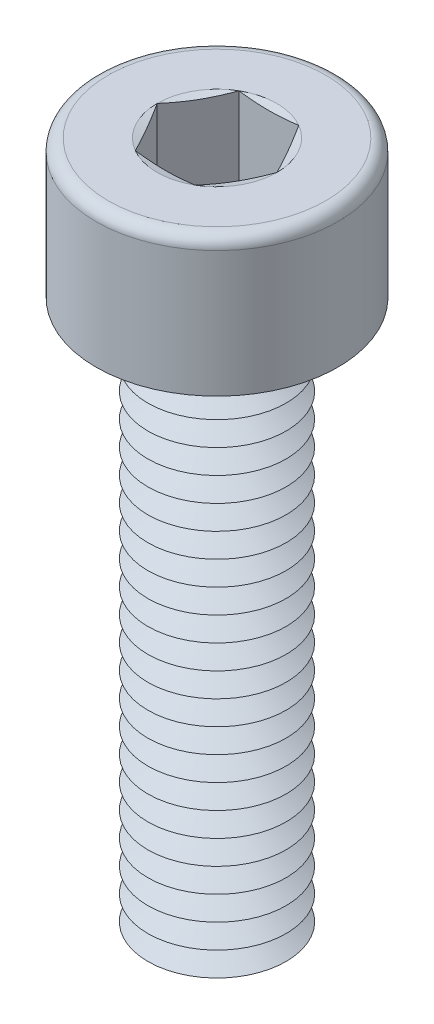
ISO-10303-21;
HEADER;
FILE_DESCRIPTION(('STEP AP214'),'2;1');
FILE_NAME('part.step','',(''),(''),'','','');
FILE_SCHEMA(('AUTOMOTIVE_DESIGN { 1 0 10303 214 1 1 1 1 }'));
ENDSEC;
DATA;
#1=APPLICATION_CONTEXT('core data for automotive mechanical design processes');
#2=APPLICATION_PROTOCOL_DEFINITION('international standard','automotive_design',2000,#1);
#3=PRODUCT_CONTEXT('',#1,'mechanical');
#4=PRODUCT('Part','Part','',(#3));
#5=PRODUCT_RELATED_PRODUCT_CATEGORY('part','',(#4));
#6=PRODUCT_DEFINITION_FORMATION('','',#4);
#7=PRODUCT_DEFINITION_CONTEXT('part definition',#1,'design');
#8=PRODUCT_DEFINITION('design','',#6,#7);
#9=PRODUCT_DEFINITION_SHAPE('','',#8);
#10=(LENGTH_UNIT() NAMED_UNIT(*) SI_UNIT(.MILLI.,.METRE.));
#11=(NAMED_UNIT(*) PLANE_ANGLE_UNIT() SI_UNIT($,.RADIAN.));
#12=(NAMED_UNIT(*) SI_UNIT($,.STERADIAN.) SOLID_ANGLE_UNIT());
#13=UNCERTAINTY_MEASURE_WITH_UNIT(LENGTH_MEASURE(1.E-05),#10,'distance_accuracy_value','');
#14=(GEOMETRIC_REPRESENTATION_CONTEXT(3) GLOBAL_UNCERTAINTY_ASSIGNED_CONTEXT((#13)) GLOBAL_UNIT_ASSIGNED_CONTEXT((#10,
#11,#12)) REPRESENTATION_CONTEXT('',''));
#15=CARTESIAN_POINT('',(0.,0.,0.));
#16=DIRECTION('',(0.,0.,1.));
#17=DIRECTION('',(1.,0.,0.));
#18=AXIS2_PLACEMENT_3D('',#15,#16,#17);
#19=CARTESIAN_POINT('',(0.,2.8,0.));
#20=DIRECTION('',(0.,1.,0.));
#21=DIRECTION('',(0.,0.,1.));
#22=AXIS2_PLACEMENT_3D('',#19,#20,#21);
#23=CONICAL_SURFACE('',#22,1.39378221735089,1.0471975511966);
#24=CARTESIAN_POINT('',(0.,3.15,0.));
#25=DIRECTION('',(0.,1.,0.));
#26=DIRECTION('',(0.,0.,1.));
#27=AXIS2_PLACEMENT_3D('',#24,#25,#26);
#28=CIRCLE('',#27,2.);
#29=CARTESIAN_POINT('',(0.,3.15,2.));
#30=VERTEX_POINT('',#29);
#31=EDGE_CURVE('E493',#30,#30,#28,.T.);
#32=ORIENTED_EDGE('',*,*,#31,.F.);
#33=EDGE_LOOP('',(#32));
#34=FACE_BOUND('',#33,.T.);
#35=CARTESIAN_POINT('',(0.,2.8,0.));
#36=DIRECTION('',(0.,1.,0.));
#37=DIRECTION('',(0.,0.,1.));
#38=AXIS2_PLACEMENT_3D('',#35,#36,#37);
#39=CIRCLE('',#38,1.39378221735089);
#40=CARTESIAN_POINT('',(0.,2.8,1.39378221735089));
#41=VERTEX_POINT('',#40);
#42=EDGE_CURVE('E497',#41,#41,#39,.T.);
#43=ORIENTED_EDGE('',*,*,#42,.T.);
#44=EDGE_LOOP('',(#43));
#45=FACE_BOUND('',#44,.T.);
#46=ADVANCED_FACE('F41',(#34,#45),#23,.T.);
#47=CARTESIAN_POINT('',(0.,2.45,0.));
#48=DIRECTION('',(0.,-1.,0.));
#49=DIRECTION('',(0.,0.,-1.));
#50=AXIS2_PLACEMENT_3D('',#47,#48,#49);
#51=CONICAL_SURFACE('',#50,2.,1.0471975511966);
#52=ORIENTED_EDGE('',*,*,#42,.F.);
#53=EDGE_LOOP('',(#52));
#54=FACE_BOUND('',#53,.T.);
#55=CARTESIAN_POINT('',(0.,2.45,0.));
#56=DIRECTION('',(0.,1.,0.));
#57=DIRECTION('',(0.,0.,1.));
#58=AXIS2_PLACEMENT_3D('',#55,#56,#57);
#59=CIRCLE('',#58,2.);
#60=CARTESIAN_POINT('',(0.,2.45,2.));
#61=VERTEX_POINT('',#60);
#62=EDGE_CURVE('E501',#61,#61,#59,.T.);
#63=ORIENTED_EDGE('',*,*,#62,.T.);
#64=EDGE_LOOP('',(#63));
#65=FACE_BOUND('',#64,.T.);
#66=ADVANCED_FACE('F251',(#54,#65),#51,.T.);
#67=CARTESIAN_POINT('',(0.,0.,0.));
#68=DIRECTION('',(0.,1.,0.));
#69=DIRECTION('',(0.,0.,1.));
#70=AXIS2_PLACEMENT_3D('',#67,#68,#69);
#71=PLANE('',#70);
#72=CARTESIAN_POINT('',(0.,0.,0.));
#73=DIRECTION('',(0.,1.,0.));
#74=DIRECTION('',(0.,0.,1.));
#75=AXIS2_PLACEMENT_3D('',#72,#73,#74);
#76=CIRCLE('',#75,1.39378221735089);
#77=CARTESIAN_POINT('',(0.,0.,1.39378221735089));
#78=VERTEX_POINT('',#77);
#79=EDGE_CURVE('E529',#78,#78,#76,.T.);
#80=ORIENTED_EDGE('',*,*,#79,.F.);
#81=EDGE_LOOP('',(#80));
#82=FACE_BOUND('',#81,.T.);
#83=ADVANCED_FACE('F248',(#82),#71,.F.);
#84=CARTESIAN_POINT('',(0.,0.,0.));
#85=DIRECTION('',(0.,1.,0.));
#86=DIRECTION('',(0.,0.,1.));
#87=AXIS2_PLACEMENT_3D('',#84,#85,#86);
#88=CONICAL_SURFACE('',#87,1.39378221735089,1.0471975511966);
#89=CARTESIAN_POINT('',(0.,0.35,0.));
#90=DIRECTION('',(0.,1.,0.));
#91=DIRECTION('',(0.,0.,1.));
#92=AXIS2_PLACEMENT_3D('',#89,#90,#91);
#93=CIRCLE('',#92,2.);
#94=CARTESIAN_POINT('',(0.,0.35,2.));
#95=VERTEX_POINT('',#94);
#96=EDGE_CURVE('E525',#95,#95,#93,.T.);
#97=ORIENTED_EDGE('',*,*,#96,.F.);
#98=EDGE_LOOP('',(#97));
#99=FACE_BOUND('',#98,.T.);
#100=ORIENTED_EDGE('',*,*,#79,.T.);
#101=EDGE_LOOP('',(#100));
#102=FACE_BOUND('',#101,.T.);
#103=ADVANCED_FACE('F250',(#99,#102),#88,.T.);
#104=CARTESIAN_POINT('',(0.,0.35,0.));
#105=DIRECTION('',(0.,-1.,0.));
#106=DIRECTION('',(0.,0.,-1.));
#107=AXIS2_PLACEMENT_3D('',#104,#105,#106);
#108=CONICAL_SURFACE('',#107,2.,1.0471975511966);
#109=CARTESIAN_POINT('',(0.,0.7,0.));
#110=DIRECTION('',(0.,1.,0.));
#111=DIRECTION('',(0.,0.,1.));
#112=AXIS2_PLACEMENT_3D('',#109,#110,#111);
#113=CIRCLE('',#112,1.39378221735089);
#114=CARTESIAN_POINT('',(0.,0.7,1.39378221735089));
#115=VERTEX_POINT('',#114);
#116=EDGE_CURVE('E521',#115,#115,#113,.T.);
#117=ORIENTED_EDGE('',*,*,#116,.F.);
#118=EDGE_LOOP('',(#117));
#119=FACE_BOUND('',#118,.T.);
#120=ORIENTED_EDGE('',*,*,#96,.T.);
#121=EDGE_LOOP('',(#120));
#122=FACE_BOUND('',#121,.T.);
#123=ADVANCED_FACE('F291',(#119,#122),#108,.T.);
#124=CARTESIAN_POINT('',(0.,0.7,0.));
#125=DIRECTION('',(0.,1.,0.));
#126=DIRECTION('',(0.,0.,1.));
#127=AXIS2_PLACEMENT_3D('',#124,#125,#126);
#128=CONICAL_SURFACE('',#127,1.39378221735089,1.0471975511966);
#129=CARTESIAN_POINT('',(0.,1.05,0.));
#130=DIRECTION('',(0.,1.,0.));
#131=DIRECTION('',(0.,0.,1.));
#132=AXIS2_PLACEMENT_3D('',#129,#130,#131);
#133=CIRCLE('',#132,2.);
#134=CARTESIAN_POINT('',(0.,1.05,2.));
#135=VERTEX_POINT('',#134);
#136=EDGE_CURVE('E517',#135,#135,#133,.T.);
#137=ORIENTED_EDGE('',*,*,#136,.F.);
#138=EDGE_LOOP('',(#137));
#139=FACE_BOUND('',#138,.T.);
#140=ORIENTED_EDGE('',*,*,#116,.T.);
#141=EDGE_LOOP('',(#140));
#142=FACE_BOUND('',#141,.T.);
#143=ADVANCED_FACE('F286',(#139,#142),#128,.T.);
#144=CARTESIAN_POINT('',(0.,1.05,0.));
#145=DIRECTION('',(0.,-1.,0.));
#146=DIRECTION('',(0.,0.,-1.));
#147=AXIS2_PLACEMENT_3D('',#144,#145,#146);
#148=CONICAL_SURFACE('',#147,2.,1.0471975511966);
#149=CARTESIAN_POINT('',(0.,1.4,0.));
#150=DIRECTION('',(0.,1.,0.));
#151=DIRECTION('',(0.,0.,1.));
#152=AXIS2_PLACEMENT_3D('',#149,#150,#151);
#153=CIRCLE('',#152,1.39378221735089);
#154=CARTESIAN_POINT('',(0.,1.4,1.39378221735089));
#155=VERTEX_POINT('',#154);
#156=EDGE_CURVE('E513',#155,#155,#153,.T.);
#157=ORIENTED_EDGE('',*,*,#156,.F.);
#158=EDGE_LOOP('',(#157));
#159=FACE_BOUND('',#158,.T.);
#160=ORIENTED_EDGE('',*,*,#136,.T.);
#161=EDGE_LOOP('',(#160));
#162=FACE_BOUND('',#161,.T.);
#163=ADVANCED_FACE('F283',(#159,#162),#148,.T.);
#164=CARTESIAN_POINT('',(0.,1.4,0.));
#165=DIRECTION('',(0.,1.,0.));
#166=DIRECTION('',(0.,0.,1.));
#167=AXIS2_PLACEMENT_3D('',#164,#165,#166);
#168=CONICAL_SURFACE('',#167,1.39378221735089,1.0471975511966);
#169=CARTESIAN_POINT('',(0.,1.75,0.));
#170=DIRECTION('',(0.,1.,0.));
#171=DIRECTION('',(0.,0.,1.));
#172=AXIS2_PLACEMENT_3D('',#169,#170,#171);
#173=CIRCLE('',#172,2.);
#174=CARTESIAN_POINT('',(0.,1.75,2.));
#175=VERTEX_POINT('',#174);
#176=EDGE_CURVE('E509',#175,#175,#173,.T.);
#177=ORIENTED_EDGE('',*,*,#176,.F.);
#178=EDGE_LOOP('',(#177));
#179=FACE_BOUND('',#178,.T.);
#180=ORIENTED_EDGE('',*,*,#156,.T.);
#181=EDGE_LOOP('',(#180));
#182=FACE_BOUND('',#181,.T.);
#183=ADVANCED_FACE('F277',(#179,#182),#168,.T.);
#184=CARTESIAN_POINT('',(0.,1.75,0.));
#185=DIRECTION('',(0.,-1.,0.));
#186=DIRECTION('',(0.,0.,-1.));
#187=AXIS2_PLACEMENT_3D('',#184,#185,#186);
#188=CONICAL_SURFACE('',#187,2.,1.0471975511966);
#189=CARTESIAN_POINT('',(0.,2.1,0.));
#190=DIRECTION('',(0.,1.,0.));
#191=DIRECTION('',(0.,0.,1.));
#192=AXIS2_PLACEMENT_3D('',#189,#190,#191);
#193=CIRCLE('',#192,1.39378221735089);
#194=CARTESIAN_POINT('',(0.,2.1,1.39378221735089));
#195=VERTEX_POINT('',#194);
#196=EDGE_CURVE('E505',#195,#195,#193,.T.);
#197=ORIENTED_EDGE('',*,*,#196,.F.);
#198=EDGE_LOOP('',(#197));
#199=FACE_BOUND('',#198,.T.);
#200=ORIENTED_EDGE('',*,*,#176,.T.);
#201=EDGE_LOOP('',(#200));
#202=FACE_BOUND('',#201,.T.);
#203=ADVANCED_FACE('F273',(#199,#202),#188,.T.);
#204=CARTESIAN_POINT('',(0.,2.1,0.));
#205=DIRECTION('',(0.,1.,0.));
#206=DIRECTION('',(0.,0.,1.));
#207=AXIS2_PLACEMENT_3D('',#204,#205,#206);
#208=CONICAL_SURFACE('',#207,1.39378221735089,1.0471975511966);
#209=ORIENTED_EDGE('',*,*,#62,.F.);
#210=EDGE_LOOP('',(#209));
#211=FACE_BOUND('',#210,.T.);
#212=ORIENTED_EDGE('',*,*,#196,.T.);
#213=EDGE_LOOP('',(#212));
#214=FACE_BOUND('',#213,.T.);
#215=ADVANCED_FACE('F276',(#211,#214),#208,.T.);
#216=CARTESIAN_POINT('',(0.,3.5,0.));
#217=DIRECTION('',(0.,1.,0.));
#218=DIRECTION('',(0.,0.,1.));
#219=AXIS2_PLACEMENT_3D('',#216,#217,#218);
#220=CONICAL_SURFACE('',#219,1.39378221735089,1.0471975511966);
#221=CARTESIAN_POINT('',(0.,3.85,0.));
#222=DIRECTION('',(0.,1.,0.));
#223=DIRECTION('',(0.,0.,1.));
#224=AXIS2_PLACEMENT_3D('',#221,#222,#223);
#225=CIRCLE('',#224,2.);
#226=CARTESIAN_POINT('',(0.,3.85,2.));
#227=VERTEX_POINT('',#226);
#228=EDGE_CURVE('E485',#227,#227,#225,.T.);
#229=ORIENTED_EDGE('',*,*,#228,.F.);
#230=EDGE_LOOP('',(#229));
#231=FACE_BOUND('',#230,.T.);
#232=CARTESIAN_POINT('',(0.,3.5,0.));
#233=DIRECTION('',(0.,1.,0.));
#234=DIRECTION('',(0.,0.,1.));
#235=AXIS2_PLACEMENT_3D('',#232,#233,#234);
#236=CIRCLE('',#235,1.39378221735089);
#237=CARTESIAN_POINT('',(0.,3.5,1.39378221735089));
#238=VERTEX_POINT('',#237);
#239=EDGE_CURVE('E489',#238,#238,#236,.T.);
#240=ORIENTED_EDGE('',*,*,#239,.T.);
#241=EDGE_LOOP('',(#240));
#242=FACE_BOUND('',#241,.T.);
#243=ADVANCED_FACE('F281',(#231,#242),#220,.T.);
#244=CARTESIAN_POINT('',(0.,3.15,0.));
#245=DIRECTION('',(0.,-1.,0.));
#246=DIRECTION('',(0.,0.,-1.));
#247=AXIS2_PLACEMENT_3D('',#244,#245,#246);
#248=CONICAL_SURFACE('',#247,2.,1.0471975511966);
#249=ORIENTED_EDGE('',*,*,#239,.F.);
#250=EDGE_LOOP('',(#249));
#251=FACE_BOUND('',#250,.T.);
#252=ORIENTED_EDGE('',*,*,#31,.T.);
#253=EDGE_LOOP('',(#252));
#254=FACE_BOUND('',#253,.T.);
#255=ADVANCED_FACE('F774',(#251,#254),#248,.T.);
#256=CARTESIAN_POINT('',(0.,4.2,0.));
#257=DIRECTION('',(0.,1.,0.));
#258=DIRECTION('',(0.,0.,1.));
#259=AXIS2_PLACEMENT_3D('',#256,#257,#258);
#260=CONICAL_SURFACE('',#259,1.39378221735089,1.0471975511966);
#261=CARTESIAN_POINT('',(0.,4.55,0.));
#262=DIRECTION('',(0.,1.,0.));
#263=DIRECTION('',(0.,0.,1.));
#264=AXIS2_PLACEMENT_3D('',#261,#262,#263);
#265=CIRCLE('',#264,2.);
#266=CARTESIAN_POINT('',(0.,4.55,2.));
#267=VERTEX_POINT('',#266);
#268=EDGE_CURVE('E477',#267,#267,#265,.T.);
#269=ORIENTED_EDGE('',*,*,#268,.F.);
#270=EDGE_LOOP('',(#269));
#271=FACE_BOUND('',#270,.T.);
#272=CARTESIAN_POINT('',(0.,4.2,0.));
#273=DIRECTION('',(0.,1.,0.));
#274=DIRECTION('',(0.,0.,1.));
#275=AXIS2_PLACEMENT_3D('',#272,#273,#274);
#276=CIRCLE('',#275,1.39378221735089);
#277=CARTESIAN_POINT('',(0.,4.2,1.39378221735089));
#278=VERTEX_POINT('',#277);
#279=EDGE_CURVE('E481',#278,#278,#276,.T.);
#280=ORIENTED_EDGE('',*,*,#279,.T.);
#281=EDGE_LOOP('',(#280));
#282=FACE_BOUND('',#281,.T.);
#283=ADVANCED_FACE('F783',(#271,#282),#260,.T.);
#284=CARTESIAN_POINT('',(0.,3.85,0.));
#285=DIRECTION('',(0.,-1.,0.));
#286=DIRECTION('',(0.,0.,-1.));
#287=AXIS2_PLACEMENT_3D('',#284,#285,#286);
#288=CONICAL_SURFACE('',#287,2.,1.0471975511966);
#289=ORIENTED_EDGE('',*,*,#279,.F.);
#290=EDGE_LOOP('',(#289));
#291=FACE_BOUND('',#290,.T.);
#292=ORIENTED_EDGE('',*,*,#228,.T.);
#293=EDGE_LOOP('',(#292));
#294=FACE_BOUND('',#293,.T.);
#295=ADVANCED_FACE('F793',(#291,#294),#288,.T.);
#296=CARTESIAN_POINT('',(0.,4.9,0.));
#297=DIRECTION('',(0.,1.,0.));
#298=DIRECTION('',(0.,0.,1.));
#299=AXIS2_PLACEMENT_3D('',#296,#297,#298);
#300=CONICAL_SURFACE('',#299,1.39378221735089,1.0471975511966);
#301=CARTESIAN_POINT('',(0.,5.25,0.));
#302=DIRECTION('',(0.,1.,0.));
#303=DIRECTION('',(0.,0.,1.));
#304=AXIS2_PLACEMENT_3D('',#301,#302,#303);
#305=CIRCLE('',#304,2.);
#306=CARTESIAN_POINT('',(0.,5.25,2.));
#307=VERTEX_POINT('',#306);
#308=EDGE_CURVE('E469',#307,#307,#305,.T.);
#309=ORIENTED_EDGE('',*,*,#308,.F.);
#310=EDGE_LOOP('',(#309));
#311=FACE_BOUND('',#310,.T.);
#312=CARTESIAN_POINT('',(0.,4.9,0.));
#313=DIRECTION('',(0.,1.,0.));
#314=DIRECTION('',(0.,0.,1.));
#315=AXIS2_PLACEMENT_3D('',#312,#313,#314);
#316=CIRCLE('',#315,1.39378221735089);
#317=CARTESIAN_POINT('',(0.,4.9,1.39378221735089));
#318=VERTEX_POINT('',#317);
#319=EDGE_CURVE('E473',#318,#318,#316,.T.);
#320=ORIENTED_EDGE('',*,*,#319,.T.);
#321=EDGE_LOOP('',(#320));
#322=FACE_BOUND('',#321,.T.);
#323=ADVANCED_FACE('F803',(#311,#322),#300,.T.);
#324=CARTESIAN_POINT('',(0.,4.55,0.));
#325=DIRECTION('',(0.,-1.,0.));
#326=DIRECTION('',(0.,0.,-1.));
#327=AXIS2_PLACEMENT_3D('',#324,#325,#326);
#328=CONICAL_SURFACE('',#327,2.,1.0471975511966);
#329=ORIENTED_EDGE('',*,*,#319,.F.);
#330=EDGE_LOOP('',(#329));
#331=FACE_BOUND('',#330,.T.);
#332=ORIENTED_EDGE('',*,*,#268,.T.);
#333=EDGE_LOOP('',(#332));
#334=FACE_BOUND('',#333,.T.);
#335=ADVANCED_FACE('F813',(#331,#334),#328,.T.);
#336=CARTESIAN_POINT('',(0.,5.6,0.));
#337=DIRECTION('',(0.,1.,0.));
#338=DIRECTION('',(0.,0.,1.));
#339=AXIS2_PLACEMENT_3D('',#336,#337,#338);
#340=CONICAL_SURFACE('',#339,1.39378221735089,1.0471975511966);
#341=CARTESIAN_POINT('',(0.,5.95,0.));
#342=DIRECTION('',(0.,1.,0.));
#343=DIRECTION('',(0.,0.,1.));
#344=AXIS2_PLACEMENT_3D('',#341,#342,#343);
#345=CIRCLE('',#344,2.);
#346=CARTESIAN_POINT('',(0.,5.95,2.));
#347=VERTEX_POINT('',#346);
#348=EDGE_CURVE('E461',#347,#347,#345,.T.);
#349=ORIENTED_EDGE('',*,*,#348,.F.);
#350=EDGE_LOOP('',(#349));
#351=FACE_BOUND('',#350,.T.);
#352=CARTESIAN_POINT('',(0.,5.6,0.));
#353=DIRECTION('',(0.,1.,0.));
#354=DIRECTION('',(0.,0.,1.));
#355=AXIS2_PLACEMENT_3D('',#352,#353,#354);
#356=CIRCLE('',#355,1.39378221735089);
#357=CARTESIAN_POINT('',(0.,5.6,1.39378221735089));
#358=VERTEX_POINT('',#357);
#359=EDGE_CURVE('E465',#358,#358,#356,.T.);
#360=ORIENTED_EDGE('',*,*,#359,.T.);
#361=EDGE_LOOP('',(#360));
#362=FACE_BOUND('',#361,.T.);
#363=ADVANCED_FACE('F823',(#351,#362),#340,.T.);
#364=CARTESIAN_POINT('',(0.,5.25,0.));
#365=DIRECTION('',(0.,-1.,0.));
#366=DIRECTION('',(0.,0.,-1.));
#367=AXIS2_PLACEMENT_3D('',#364,#365,#366);
#368=CONICAL_SURFACE('',#367,2.,1.0471975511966);
#369=ORIENTED_EDGE('',*,*,#359,.F.);
#370=EDGE_LOOP('',(#369));
#371=FACE_BOUND('',#370,.T.);
#372=ORIENTED_EDGE('',*,*,#308,.T.);
#373=EDGE_LOOP('',(#372));
#374=FACE_BOUND('',#373,.T.);
#375=ADVANCED_FACE('F833',(#371,#374),#368,.T.);
#376=CARTESIAN_POINT('',(0.,6.3,0.));
#377=DIRECTION('',(0.,1.,0.));
#378=DIRECTION('',(0.,0.,1.));
#379=AXIS2_PLACEMENT_3D('',#376,#377,#378);
#380=CONICAL_SURFACE('',#379,1.39378221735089,1.0471975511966);
#381=CARTESIAN_POINT('',(0.,6.65,0.));
#382=DIRECTION('',(0.,1.,0.));
#383=DIRECTION('',(0.,0.,1.));
#384=AXIS2_PLACEMENT_3D('',#381,#382,#383);
#385=CIRCLE('',#384,2.);
#386=CARTESIAN_POINT('',(0.,6.65,2.));
#387=VERTEX_POINT('',#386);
#388=EDGE_CURVE('E454',#387,#387,#385,.T.);
#389=ORIENTED_EDGE('',*,*,#388,.F.);
#390=EDGE_LOOP('',(#389));
#391=FACE_BOUND('',#390,.T.);
#392=CARTESIAN_POINT('',(0.,6.3,0.));
#393=DIRECTION('',(0.,1.,0.));
#394=DIRECTION('',(0.,0.,1.));
#395=AXIS2_PLACEMENT_3D('',#392,#393,#394);
#396=CIRCLE('',#395,1.39378221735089);
#397=CARTESIAN_POINT('',(0.,6.3,1.39378221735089));
#398=VERTEX_POINT('',#397);
#399=EDGE_CURVE('E457',#398,#398,#396,.T.);
#400=ORIENTED_EDGE('',*,*,#399,.T.);
#401=EDGE_LOOP('',(#400));
#402=FACE_BOUND('',#401,.T.);
#403=ADVANCED_FACE('F843',(#391,#402),#380,.T.);
#404=CARTESIAN_POINT('',(0.,5.95,0.));
#405=DIRECTION('',(0.,-1.,0.));
#406=DIRECTION('',(0.,0.,-1.));
#407=AXIS2_PLACEMENT_3D('',#404,#405,#406);
#408=CONICAL_SURFACE('',#407,2.,1.0471975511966);
#409=ORIENTED_EDGE('',*,*,#399,.F.);
#410=EDGE_LOOP('',(#409));
#411=FACE_BOUND('',#410,.T.);
#412=ORIENTED_EDGE('',*,*,#348,.T.);
#413=EDGE_LOOP('',(#412));
#414=FACE_BOUND('',#413,.T.);
#415=ADVANCED_FACE('F853',(#411,#414),#408,.T.);
#416=CARTESIAN_POINT('',(0.,7.,0.));
#417=DIRECTION('',(0.,1.,0.));
#418=DIRECTION('',(0.,0.,1.));
#419=AXIS2_PLACEMENT_3D('',#416,#417,#418);
#420=CONICAL_SURFACE('',#419,1.39378221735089,1.0471975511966);
#421=CARTESIAN_POINT('',(0.,7.35,0.));
#422=DIRECTION('',(0.,1.,0.));
#423=DIRECTION('',(0.,0.,1.));
#424=AXIS2_PLACEMENT_3D('',#421,#422,#423);
#425=CIRCLE('',#424,2.);
#426=CARTESIAN_POINT('',(0.,7.35,2.));
#427=VERTEX_POINT('',#426);
#428=EDGE_CURVE('E446',#427,#427,#425,.T.);
#429=ORIENTED_EDGE('',*,*,#428,.F.);
#430=EDGE_LOOP('',(#429));
#431=FACE_BOUND('',#430,.T.);
#432=CARTESIAN_POINT('',(0.,7.,0.));
#433=DIRECTION('',(0.,1.,0.));
#434=DIRECTION('',(0.,0.,1.));
#435=AXIS2_PLACEMENT_3D('',#432,#433,#434);
#436=CIRCLE('',#435,1.39378221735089);
#437=CARTESIAN_POINT('',(0.,7.,1.39378221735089));
#438=VERTEX_POINT('',#437);
#439=EDGE_CURVE('E450',#438,#438,#436,.T.);
#440=ORIENTED_EDGE('',*,*,#439,.T.);
#441=EDGE_LOOP('',(#440));
#442=FACE_BOUND('',#441,.T.);
#443=ADVANCED_FACE('F863',(#431,#442),#420,.T.);
#444=CARTESIAN_POINT('',(0.,6.65,0.));
#445=DIRECTION('',(0.,-1.,0.));
#446=DIRECTION('',(0.,0.,-1.));
#447=AXIS2_PLACEMENT_3D('',#444,#445,#446);
#448=CONICAL_SURFACE('',#447,2.,1.0471975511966);
#449=ORIENTED_EDGE('',*,*,#439,.F.);
#450=EDGE_LOOP('',(#449));
#451=FACE_BOUND('',#450,.T.);
#452=ORIENTED_EDGE('',*,*,#388,.T.);
#453=EDGE_LOOP('',(#452));
#454=FACE_BOUND('',#453,.T.);
#455=ADVANCED_FACE('F873',(#451,#454),#448,.T.);
#456=CARTESIAN_POINT('',(0.,7.7,0.));
#457=DIRECTION('',(0.,1.,0.));
#458=DIRECTION('',(0.,0.,1.));
#459=AXIS2_PLACEMENT_3D('',#456,#457,#458);
#460=CONICAL_SURFACE('',#459,1.39378221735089,1.0471975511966);
#461=CARTESIAN_POINT('',(0.,8.05,0.));
#462=DIRECTION('',(0.,1.,0.));
#463=DIRECTION('',(0.,0.,1.));
#464=AXIS2_PLACEMENT_3D('',#461,#462,#463);
#465=CIRCLE('',#464,2.);
#466=CARTESIAN_POINT('',(0.,8.05,2.));
#467=VERTEX_POINT('',#466);
#468=EDGE_CURVE('E438',#467,#467,#465,.T.);
#469=ORIENTED_EDGE('',*,*,#468,.F.);
#470=EDGE_LOOP('',(#469));
#471=FACE_BOUND('',#470,.T.);
#472=CARTESIAN_POINT('',(0.,7.7,0.));
#473=DIRECTION('',(0.,1.,0.));
#474=DIRECTION('',(0.,0.,1.));
#475=AXIS2_PLACEMENT_3D('',#472,#473,#474);
#476=CIRCLE('',#475,1.39378221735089);
#477=CARTESIAN_POINT('',(0.,7.7,1.39378221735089));
#478=VERTEX_POINT('',#477);
#479=EDGE_CURVE('E442',#478,#478,#476,.T.);
#480=ORIENTED_EDGE('',*,*,#479,.T.);
#481=EDGE_LOOP('',(#480));
#482=FACE_BOUND('',#481,.T.);
#483=ADVANCED_FACE('F883',(#471,#482),#460,.T.);
#484=CARTESIAN_POINT('',(0.,7.35,0.));
#485=DIRECTION('',(0.,-1.,0.));
#486=DIRECTION('',(0.,0.,-1.));
#487=AXIS2_PLACEMENT_3D('',#484,#485,#486);
#488=CONICAL_SURFACE('',#487,2.,1.0471975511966);
#489=ORIENTED_EDGE('',*,*,#479,.F.);
#490=EDGE_LOOP('',(#489));
#491=FACE_BOUND('',#490,.T.);
#492=ORIENTED_EDGE('',*,*,#428,.T.);
#493=EDGE_LOOP('',(#492));
#494=FACE_BOUND('',#493,.T.);
#495=ADVANCED_FACE('F893',(#491,#494),#488,.T.);
#496=CARTESIAN_POINT('',(0.,8.4,0.));
#497=DIRECTION('',(0.,1.,0.));
#498=DIRECTION('',(0.,0.,1.));
#499=AXIS2_PLACEMENT_3D('',#496,#497,#498);
#500=CONICAL_SURFACE('',#499,1.39378221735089,1.0471975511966);
#501=CARTESIAN_POINT('',(0.,8.75,0.));
#502=DIRECTION('',(0.,1.,0.));
#503=DIRECTION('',(0.,0.,1.));
#504=AXIS2_PLACEMENT_3D('',#501,#502,#503);
#505=CIRCLE('',#504,2.);
#506=CARTESIAN_POINT('',(0.,8.75,2.));
#507=VERTEX_POINT('',#506);
#508=EDGE_CURVE('E430',#507,#507,#505,.T.);
#509=ORIENTED_EDGE('',*,*,#508,.F.);
#510=EDGE_LOOP('',(#509));
#511=FACE_BOUND('',#510,.T.);
#512=CARTESIAN_POINT('',(0.,8.4,0.));
#513=DIRECTION('',(0.,1.,0.));
#514=DIRECTION('',(0.,0.,1.));
#515=AXIS2_PLACEMENT_3D('',#512,#513,#514);
#516=CIRCLE('',#515,1.39378221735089);
#517=CARTESIAN_POINT('',(0.,8.4,1.39378221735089));
#518=VERTEX_POINT('',#517);
#519=EDGE_CURVE('E434',#518,#518,#516,.T.);
#520=ORIENTED_EDGE('',*,*,#519,.T.);
#521=EDGE_LOOP('',(#520));
#522=FACE_BOUND('',#521,.T.);
#523=ADVANCED_FACE('F903',(#511,#522),#500,.T.);
#524=CARTESIAN_POINT('',(0.,8.05,0.));
#525=DIRECTION('',(0.,-1.,0.));
#526=DIRECTION('',(0.,0.,-1.));
#527=AXIS2_PLACEMENT_3D('',#524,#525,#526);
#528=CONICAL_SURFACE('',#527,2.,1.0471975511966);
#529=ORIENTED_EDGE('',*,*,#519,.F.);
#530=EDGE_LOOP('',(#529));
#531=FACE_BOUND('',#530,.T.);
#532=ORIENTED_EDGE('',*,*,#468,.T.);
#533=EDGE_LOOP('',(#532));
#534=FACE_BOUND('',#533,.T.);
#535=ADVANCED_FACE('F913',(#531,#534),#528,.T.);
#536=CARTESIAN_POINT('',(0.,9.1,0.));
#537=DIRECTION('',(0.,1.,0.));
#538=DIRECTION('',(0.,0.,1.));
#539=AXIS2_PLACEMENT_3D('',#536,#537,#538);
#540=CONICAL_SURFACE('',#539,1.39378221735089,1.0471975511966);
#541=CARTESIAN_POINT('',(0.,9.45,0.));
#542=DIRECTION('',(0.,1.,0.));
#543=DIRECTION('',(0.,0.,1.));
#544=AXIS2_PLACEMENT_3D('',#541,#542,#543);
#545=CIRCLE('',#544,2.);
#546=CARTESIAN_POINT('',(0.,9.45,2.));
#547=VERTEX_POINT('',#546);
#548=EDGE_CURVE('E422',#547,#547,#545,.T.);
#549=ORIENTED_EDGE('',*,*,#548,.F.);
#550=EDGE_LOOP('',(#549));
#551=FACE_BOUND('',#550,.T.);
#552=CARTESIAN_POINT('',(0.,9.1,0.));
#553=DIRECTION('',(0.,1.,0.));
#554=DIRECTION('',(0.,0.,1.));
#555=AXIS2_PLACEMENT_3D('',#552,#553,#554);
#556=CIRCLE('',#555,1.39378221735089);
#557=CARTESIAN_POINT('',(0.,9.1,1.39378221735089));
#558=VERTEX_POINT('',#557);
#559=EDGE_CURVE('E426',#558,#558,#556,.T.);
#560=ORIENTED_EDGE('',*,*,#559,.T.);
#561=EDGE_LOOP('',(#560));
#562=FACE_BOUND('',#561,.T.);
#563=ADVANCED_FACE('F923',(#551,#562),#540,.T.);
#564=CARTESIAN_POINT('',(0.,8.75,0.));
#565=DIRECTION('',(0.,-1.,0.));
#566=DIRECTION('',(0.,0.,-1.));
#567=AXIS2_PLACEMENT_3D('',#564,#565,#566);
#568=CONICAL_SURFACE('',#567,2.,1.0471975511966);
#569=ORIENTED_EDGE('',*,*,#559,.F.);
#570=EDGE_LOOP('',(#569));
#571=FACE_BOUND('',#570,.T.);
#572=ORIENTED_EDGE('',*,*,#508,.T.);
#573=EDGE_LOOP('',(#572));
#574=FACE_BOUND('',#573,.T.);
#575=ADVANCED_FACE('F933',(#571,#574),#568,.T.);
#576=CARTESIAN_POINT('',(0.,9.8,0.));
#577=DIRECTION('',(0.,1.,0.));
#578=DIRECTION('',(0.,0.,1.));
#579=AXIS2_PLACEMENT_3D('',#576,#577,#578);
#580=CONICAL_SURFACE('',#579,1.39378221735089,1.0471975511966);
#581=CARTESIAN_POINT('',(0.,10.15,0.));
#582=DIRECTION('',(0.,1.,0.));
#583=DIRECTION('',(0.,0.,1.));
#584=AXIS2_PLACEMENT_3D('',#581,#582,#583);
#585=CIRCLE('',#584,2.);
#586=CARTESIAN_POINT('',(0.,10.15,2.));
#587=VERTEX_POINT('',#586);
#588=EDGE_CURVE('E414',#587,#587,#585,.T.);
#589=ORIENTED_EDGE('',*,*,#588,.F.);
#590=EDGE_LOOP('',(#589));
#591=FACE_BOUND('',#590,.T.);
#592=CARTESIAN_POINT('',(0.,9.8,0.));
#593=DIRECTION('',(0.,1.,0.));
#594=DIRECTION('',(0.,0.,1.));
#595=AXIS2_PLACEMENT_3D('',#592,#593,#594);
#596=CIRCLE('',#595,1.39378221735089);
#597=CARTESIAN_POINT('',(0.,9.8,1.39378221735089));
#598=VERTEX_POINT('',#597);
#599=EDGE_CURVE('E418',#598,#598,#596,.T.);
#600=ORIENTED_EDGE('',*,*,#599,.T.);
#601=EDGE_LOOP('',(#600));
#602=FACE_BOUND('',#601,.T.);
#603=ADVANCED_FACE('F943',(#591,#602),#580,.T.);
#604=CARTESIAN_POINT('',(0.,9.45,0.));
#605=DIRECTION('',(0.,-1.,0.));
#606=DIRECTION('',(0.,0.,-1.));
#607=AXIS2_PLACEMENT_3D('',#604,#605,#606);
#608=CONICAL_SURFACE('',#607,2.,1.0471975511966);
#609=ORIENTED_EDGE('',*,*,#599,.F.);
#610=EDGE_LOOP('',(#609));
#611=FACE_BOUND('',#610,.T.);
#612=ORIENTED_EDGE('',*,*,#548,.T.);
#613=EDGE_LOOP('',(#612));
#614=FACE_BOUND('',#613,.T.);
#615=ADVANCED_FACE('F953',(#611,#614),#608,.T.);
#616=CARTESIAN_POINT('',(0.,10.5,0.));
#617=DIRECTION('',(0.,1.,0.));
#618=DIRECTION('',(0.,0.,1.));
#619=AXIS2_PLACEMENT_3D('',#616,#617,#618);
#620=CONICAL_SURFACE('',#619,1.39378221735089,1.0471975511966);
#621=CARTESIAN_POINT('',(0.,10.85,0.));
#622=DIRECTION('',(0.,1.,0.));
#623=DIRECTION('',(0.,0.,1.));
#624=AXIS2_PLACEMENT_3D('',#621,#622,#623);
#625=CIRCLE('',#624,2.);
#626=CARTESIAN_POINT('',(0.,10.85,2.));
#627=VERTEX_POINT('',#626);
#628=EDGE_CURVE('E406',#627,#627,#625,.T.);
#629=ORIENTED_EDGE('',*,*,#628,.F.);
#630=EDGE_LOOP('',(#629));
#631=FACE_BOUND('',#630,.T.);
#632=CARTESIAN_POINT('',(0.,10.5,0.));
#633=DIRECTION('',(0.,1.,0.));
#634=DIRECTION('',(0.,0.,1.));
#635=AXIS2_PLACEMENT_3D('',#632,#633,#634);
#636=CIRCLE('',#635,1.39378221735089);
#637=CARTESIAN_POINT('',(0.,10.5,1.39378221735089));
#638=VERTEX_POINT('',#637);
#639=EDGE_CURVE('E410',#638,#638,#636,.T.);
#640=ORIENTED_EDGE('',*,*,#639,.T.);
#641=EDGE_LOOP('',(#640));
#642=FACE_BOUND('',#641,.T.);
#643=ADVANCED_FACE('F963',(#631,#642),#620,.T.);
#644=CARTESIAN_POINT('',(0.,10.15,0.));
#645=DIRECTION('',(0.,-1.,0.));
#646=DIRECTION('',(0.,0.,-1.));
#647=AXIS2_PLACEMENT_3D('',#644,#645,#646);
#648=CONICAL_SURFACE('',#647,2.,1.0471975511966);
#649=ORIENTED_EDGE('',*,*,#639,.F.);
#650=EDGE_LOOP('',(#649));
#651=FACE_BOUND('',#650,.T.);
#652=ORIENTED_EDGE('',*,*,#588,.T.);
#653=EDGE_LOOP('',(#652));
#654=FACE_BOUND('',#653,.T.);
#655=ADVANCED_FACE('F973',(#651,#654),#648,.T.);
#656=CARTESIAN_POINT('',(0.,11.2,0.));
#657=DIRECTION('',(0.,1.,0.));
#658=DIRECTION('',(0.,0.,1.));
#659=AXIS2_PLACEMENT_3D('',#656,#657,#658);
#660=CONICAL_SURFACE('',#659,1.39378221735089,1.0471975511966);
#661=CARTESIAN_POINT('',(0.,11.55,0.));
#662=DIRECTION('',(0.,1.,0.));
#663=DIRECTION('',(0.,0.,1.));
#664=AXIS2_PLACEMENT_3D('',#661,#662,#663);
#665=CIRCLE('',#664,2.);
#666=CARTESIAN_POINT('',(0.,11.55,2.));
#667=VERTEX_POINT('',#666);
#668=EDGE_CURVE('E399',#667,#667,#665,.T.);
#669=ORIENTED_EDGE('',*,*,#668,.F.);
#670=EDGE_LOOP('',(#669));
#671=FACE_BOUND('',#670,.T.);
#672=CARTESIAN_POINT('',(0.,11.2,0.));
#673=DIRECTION('',(0.,1.,0.));
#674=DIRECTION('',(0.,0.,1.));
#675=AXIS2_PLACEMENT_3D('',#672,#673,#674);
#676=CIRCLE('',#675,1.39378221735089);
#677=CARTESIAN_POINT('',(0.,11.2,1.39378221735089));
#678=VERTEX_POINT('',#677);
#679=EDGE_CURVE('E402',#678,#678,#676,.T.);
#680=ORIENTED_EDGE('',*,*,#679,.T.);
#681=EDGE_LOOP('',(#680));
#682=FACE_BOUND('',#681,.T.);
#683=ADVANCED_FACE('F983',(#671,#682),#660,.T.);
#684=CARTESIAN_POINT('',(0.,10.85,0.));
#685=DIRECTION('',(0.,-1.,0.));
#686=DIRECTION('',(0.,0.,-1.));
#687=AXIS2_PLACEMENT_3D('',#684,#685,#686);
#688=CONICAL_SURFACE('',#687,2.,1.0471975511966);
#689=ORIENTED_EDGE('',*,*,#679,.F.);
#690=EDGE_LOOP('',(#689));
#691=FACE_BOUND('',#690,.T.);
#692=ORIENTED_EDGE('',*,*,#628,.T.);
#693=EDGE_LOOP('',(#692));
#694=FACE_BOUND('',#693,.T.);
#695=ADVANCED_FACE('F993',(#691,#694),#688,.T.);
#696=CARTESIAN_POINT('',(0.,11.9,0.));
#697=DIRECTION('',(0.,1.,0.));
#698=DIRECTION('',(0.,0.,1.));
#699=AXIS2_PLACEMENT_3D('',#696,#697,#698);
#700=CONICAL_SURFACE('',#699,1.39378221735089,1.0471975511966);
#701=CARTESIAN_POINT('',(0.,12.25,0.));
#702=DIRECTION('',(0.,1.,0.));
#703=DIRECTION('',(0.,0.,1.));
#704=AXIS2_PLACEMENT_3D('',#701,#702,#703);
#705=CIRCLE('',#704,2.);
#706=CARTESIAN_POINT('',(0.,12.25,2.));
#707=VERTEX_POINT('',#706);
#708=EDGE_CURVE('E391',#707,#707,#705,.T.);
#709=ORIENTED_EDGE('',*,*,#708,.F.);
#710=EDGE_LOOP('',(#709));
#711=FACE_BOUND('',#710,.T.);
#712=CARTESIAN_POINT('',(0.,11.9,0.));
#713=DIRECTION('',(0.,1.,0.));
#714=DIRECTION('',(0.,0.,1.));
#715=AXIS2_PLACEMENT_3D('',#712,#713,#714);
#716=CIRCLE('',#715,1.39378221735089);
#717=CARTESIAN_POINT('',(0.,11.9,1.39378221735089));
#718=VERTEX_POINT('',#717);
#719=EDGE_CURVE('E395',#718,#718,#716,.T.);
#720=ORIENTED_EDGE('',*,*,#719,.T.);
#721=EDGE_LOOP('',(#720));
#722=FACE_BOUND('',#721,.T.);
#723=ADVANCED_FACE('F1003',(#711,#722),#700,.T.);
#724=CARTESIAN_POINT('',(0.,11.55,0.));
#725=DIRECTION('',(0.,-1.,0.));
#726=DIRECTION('',(0.,0.,-1.));
#727=AXIS2_PLACEMENT_3D('',#724,#725,#726);
#728=CONICAL_SURFACE('',#727,2.,1.0471975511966);
#729=ORIENTED_EDGE('',*,*,#719,.F.);
#730=EDGE_LOOP('',(#729));
#731=FACE_BOUND('',#730,.T.);
#732=ORIENTED_EDGE('',*,*,#668,.T.);
#733=EDGE_LOOP('',(#732));
#734=FACE_BOUND('',#733,.T.);
#735=ADVANCED_FACE('F1013',(#731,#734),#728,.T.);
#736=CARTESIAN_POINT('',(0.,12.6,0.));
#737=DIRECTION('',(0.,1.,0.));
#738=DIRECTION('',(0.,0.,1.));
#739=AXIS2_PLACEMENT_3D('',#736,#737,#738);
#740=CONICAL_SURFACE('',#739,1.39378221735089,1.0471975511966);
#741=CARTESIAN_POINT('',(0.,12.95,0.));
#742=DIRECTION('',(0.,1.,0.));
#743=DIRECTION('',(0.,0.,1.));
#744=AXIS2_PLACEMENT_3D('',#741,#742,#743);
#745=CIRCLE('',#744,2.);
#746=CARTESIAN_POINT('',(0.,12.95,2.));
#747=VERTEX_POINT('',#746);
#748=EDGE_CURVE('E383',#747,#747,#745,.T.);
#749=ORIENTED_EDGE('',*,*,#748,.F.);
#750=EDGE_LOOP('',(#749));
#751=FACE_BOUND('',#750,.T.);
#752=CARTESIAN_POINT('',(0.,12.6,0.));
#753=DIRECTION('',(0.,1.,0.));
#754=DIRECTION('',(0.,0.,1.));
#755=AXIS2_PLACEMENT_3D('',#752,#753,#754);
#756=CIRCLE('',#755,1.39378221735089);
#757=CARTESIAN_POINT('',(0.,12.6,1.39378221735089));
#758=VERTEX_POINT('',#757);
#759=EDGE_CURVE('E387',#758,#758,#756,.T.);
#760=ORIENTED_EDGE('',*,*,#759,.T.);
#761=EDGE_LOOP('',(#760));
#762=FACE_BOUND('',#761,.T.);
#763=ADVANCED_FACE('F1023',(#751,#762),#740,.T.);
#764=CARTESIAN_POINT('',(0.,12.25,0.));
#765=DIRECTION('',(0.,-1.,0.));
#766=DIRECTION('',(0.,0.,-1.));
#767=AXIS2_PLACEMENT_3D('',#764,#765,#766);
#768=CONICAL_SURFACE('',#767,2.,1.0471975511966);
#769=ORIENTED_EDGE('',*,*,#759,.F.);
#770=EDGE_LOOP('',(#769));
#771=FACE_BOUND('',#770,.T.);
#772=ORIENTED_EDGE('',*,*,#708,.T.);
#773=EDGE_LOOP('',(#772));
#774=FACE_BOUND('',#773,.T.);
#775=ADVANCED_FACE('F1033',(#771,#774),#768,.T.);
#776=CARTESIAN_POINT('',(0.,13.3,0.));
#777=DIRECTION('',(0.,1.,0.));
#778=DIRECTION('',(0.,0.,1.));
#779=AXIS2_PLACEMENT_3D('',#776,#777,#778);
#780=CONICAL_SURFACE('',#779,1.39378221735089,1.0471975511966);
#781=CARTESIAN_POINT('',(0.,13.65,0.));
#782=DIRECTION('',(0.,1.,0.));
#783=DIRECTION('',(0.,0.,1.));
#784=AXIS2_PLACEMENT_3D('',#781,#782,#783);
#785=CIRCLE('',#784,2.);
#786=CARTESIAN_POINT('',(0.,13.65,2.));
#787=VERTEX_POINT('',#786);
#788=EDGE_CURVE('E375',#787,#787,#785,.T.);
#789=ORIENTED_EDGE('',*,*,#788,.F.);
#790=EDGE_LOOP('',(#789));
#791=FACE_BOUND('',#790,.T.);
#792=CARTESIAN_POINT('',(0.,13.3,0.));
#793=DIRECTION('',(0.,1.,0.));
#794=DIRECTION('',(0.,0.,1.));
#795=AXIS2_PLACEMENT_3D('',#792,#793,#794);
#796=CIRCLE('',#795,1.39378221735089);
#797=CARTESIAN_POINT('',(0.,13.3,1.39378221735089));
#798=VERTEX_POINT('',#797);
#799=EDGE_CURVE('E379',#798,#798,#796,.T.);
#800=ORIENTED_EDGE('',*,*,#799,.T.);
#801=EDGE_LOOP('',(#800));
#802=FACE_BOUND('',#801,.T.);
#803=ADVANCED_FACE('F1043',(#791,#802),#780,.T.);
#804=CARTESIAN_POINT('',(0.,12.95,0.));
#805=DIRECTION('',(0.,-1.,0.));
#806=DIRECTION('',(0.,0.,-1.));
#807=AXIS2_PLACEMENT_3D('',#804,#805,#806);
#808=CONICAL_SURFACE('',#807,2.,1.0471975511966);
#809=ORIENTED_EDGE('',*,*,#799,.F.);
#810=EDGE_LOOP('',(#809));
#811=FACE_BOUND('',#810,.T.);
#812=ORIENTED_EDGE('',*,*,#748,.T.);
#813=EDGE_LOOP('',(#812));
#814=FACE_BOUND('',#813,.T.);
#815=ADVANCED_FACE('F1053',(#811,#814),#808,.T.);
#816=CARTESIAN_POINT('',(0.,14.,0.));
#817=DIRECTION('',(0.,1.,0.));
#818=DIRECTION('',(0.,0.,1.));
#819=AXIS2_PLACEMENT_3D('',#816,#817,#818);
#820=CONICAL_SURFACE('',#819,1.39378221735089,1.0471975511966);
#821=CARTESIAN_POINT('',(0.,14.35,0.));
#822=DIRECTION('',(0.,1.,0.));
#823=DIRECTION('',(0.,0.,1.));
#824=AXIS2_PLACEMENT_3D('',#821,#822,#823);
#825=CIRCLE('',#824,2.);
#826=CARTESIAN_POINT('',(0.,14.35,2.));
#827=VERTEX_POINT('',#826);
#828=EDGE_CURVE('E367',#827,#827,#825,.T.);
#829=ORIENTED_EDGE('',*,*,#828,.F.);
#830=EDGE_LOOP('',(#829));
#831=FACE_BOUND('',#830,.T.);
#832=CARTESIAN_POINT('',(0.,14.,0.));
#833=DIRECTION('',(0.,1.,0.));
#834=DIRECTION('',(0.,0.,1.));
#835=AXIS2_PLACEMENT_3D('',#832,#833,#834);
#836=CIRCLE('',#835,1.39378221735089);
#837=CARTESIAN_POINT('',(0.,14.,1.39378221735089));
#838=VERTEX_POINT('',#837);
#839=EDGE_CURVE('E371',#838,#838,#836,.T.);
#840=ORIENTED_EDGE('',*,*,#839,.T.);
#841=EDGE_LOOP('',(#840));
#842=FACE_BOUND('',#841,.T.);
#843=ADVANCED_FACE('F1063',(#831,#842),#820,.T.);
#844=CARTESIAN_POINT('',(0.,13.65,0.));
#845=DIRECTION('',(0.,-1.,0.));
#846=DIRECTION('',(0.,0.,-1.));
#847=AXIS2_PLACEMENT_3D('',#844,#845,#846);
#848=CONICAL_SURFACE('',#847,2.,1.0471975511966);
#849=ORIENTED_EDGE('',*,*,#839,.F.);
#850=EDGE_LOOP('',(#849));
#851=FACE_BOUND('',#850,.T.);
#852=ORIENTED_EDGE('',*,*,#788,.T.);
#853=EDGE_LOOP('',(#852));
#854=FACE_BOUND('',#853,.T.);
#855=ADVANCED_FACE('F1073',(#851,#854),#848,.T.);
#856=CARTESIAN_POINT('',(0.,14.7,0.));
#857=DIRECTION('',(0.,1.,0.));
#858=DIRECTION('',(0.,0.,1.));
#859=AXIS2_PLACEMENT_3D('',#856,#857,#858);
#860=CONICAL_SURFACE('',#859,1.39378221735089,1.0471975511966);
#861=CARTESIAN_POINT('',(0.,15.05,0.));
#862=DIRECTION('',(0.,1.,0.));
#863=DIRECTION('',(0.,0.,1.));
#864=AXIS2_PLACEMENT_3D('',#861,#862,#863);
#865=CIRCLE('',#864,2.);
#866=CARTESIAN_POINT('',(0.,15.05,2.));
#867=VERTEX_POINT('',#866);
#868=EDGE_CURVE('E352',#867,#867,#865,.T.);
#869=ORIENTED_EDGE('',*,*,#868,.F.);
#870=EDGE_LOOP('',(#869));
#871=FACE_BOUND('',#870,.T.);
#872=CARTESIAN_POINT('',(0.,14.7,0.));
#873=DIRECTION('',(0.,1.,0.));
#874=DIRECTION('',(0.,0.,1.));
#875=AXIS2_PLACEMENT_3D('',#872,#873,#874);
#876=CIRCLE('',#875,1.39378221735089);
#877=CARTESIAN_POINT('',(0.,14.7,1.39378221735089));
#878=VERTEX_POINT('',#877);
#879=EDGE_CURVE('E364',#878,#878,#876,.T.);
#880=ORIENTED_EDGE('',*,*,#879,.T.);
#881=EDGE_LOOP('',(#880));
#882=FACE_BOUND('',#881,.T.);
#883=ADVANCED_FACE('F1083',(#871,#882),#860,.T.);
#884=CARTESIAN_POINT('',(0.,14.35,0.));
#885=DIRECTION('',(0.,-1.,0.));
#886=DIRECTION('',(0.,0.,-1.));
#887=AXIS2_PLACEMENT_3D('',#884,#885,#886);
#888=CONICAL_SURFACE('',#887,2.,1.0471975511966);
#889=ORIENTED_EDGE('',*,*,#879,.F.);
#890=EDGE_LOOP('',(#889));
#891=FACE_BOUND('',#890,.T.);
#892=ORIENTED_EDGE('',*,*,#828,.T.);
#893=EDGE_LOOP('',(#892));
#894=FACE_BOUND('',#893,.T.);
#895=ADVANCED_FACE('F1093',(#891,#894),#888,.T.);
#896=CARTESIAN_POINT('',(0.,15.4,0.));
#897=DIRECTION('',(0.,1.,0.));
#898=DIRECTION('',(0.,0.,1.));
#899=AXIS2_PLACEMENT_3D('',#896,#897,#898);
#900=CONICAL_SURFACE('',#899,1.39378221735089,1.0471975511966);
#901=CARTESIAN_POINT('',(0.,15.75,0.));
#902=DIRECTION('',(0.,1.,0.));
#903=DIRECTION('',(0.,0.,1.));
#904=AXIS2_PLACEMENT_3D('',#901,#902,#903);
#905=CIRCLE('',#904,2.);
#906=CARTESIAN_POINT('',(0.,15.75,2.));
#907=VERTEX_POINT('',#906);
#908=EDGE_CURVE('E359',#907,#907,#905,.T.);
#909=ORIENTED_EDGE('',*,*,#908,.F.);
#910=EDGE_LOOP('',(#909));
#911=FACE_BOUND('',#910,.T.);
#912=CARTESIAN_POINT('',(0.,15.4,0.));
#913=DIRECTION('',(0.,1.,0.));
#914=DIRECTION('',(0.,0.,1.));
#915=AXIS2_PLACEMENT_3D('',#912,#913,#914);
#916=CIRCLE('',#915,1.39378221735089);
#917=CARTESIAN_POINT('',(0.,15.4,1.39378221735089));
#918=VERTEX_POINT('',#917);
#919=EDGE_CURVE('E348',#918,#918,#916,.T.);
#920=ORIENTED_EDGE('',*,*,#919,.T.);
#921=EDGE_LOOP('',(#920));
#922=FACE_BOUND('',#921,.T.);
#923=ADVANCED_FACE('F1103',(#911,#922),#900,.T.);
#924=CARTESIAN_POINT('',(0.,15.05,0.));
#925=DIRECTION('',(0.,-1.,0.));
#926=DIRECTION('',(0.,0.,-1.));
#927=AXIS2_PLACEMENT_3D('',#924,#925,#926);
#928=CONICAL_SURFACE('',#927,2.,1.0471975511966);
#929=ORIENTED_EDGE('',*,*,#919,.F.);
#930=EDGE_LOOP('',(#929));
#931=FACE_BOUND('',#930,.T.);
#932=ORIENTED_EDGE('',*,*,#868,.T.);
#933=EDGE_LOOP('',(#932));
#934=FACE_BOUND('',#933,.T.);
#935=ADVANCED_FACE('F195',(#931,#934),#928,.T.);
#936=CARTESIAN_POINT('',(0.,20.,0.));
#937=DIRECTION('',(0.,1.,0.));
#938=DIRECTION('',(0.,0.,1.));
#939=AXIS2_PLACEMENT_3D('',#936,#937,#938);
#940=PLANE('',#939);
#941=CARTESIAN_POINT('',(0.,20.,0.));
#942=DIRECTION('',(0.,1.,0.));
#943=DIRECTION('',(0.,0.,1.));
#944=AXIS2_PLACEMENT_3D('',#941,#942,#943);
#945=CIRCLE('',#944,1.73205080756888);
#946=CARTESIAN_POINT('',(0.866025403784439,20.,1.5));
#947=VERTEX_POINT('',#946);
#948=CARTESIAN_POINT('',(1.73205080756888,20.,0.));
#949=VERTEX_POINT('',#948);
#950=EDGE_CURVE('E121',#947,#949,#945,.T.);
#951=ORIENTED_EDGE('',*,*,#950,.F.);
#952=CARTESIAN_POINT('',(0.,20.,0.));
#953=DIRECTION('',(0.,1.,0.));
#954=DIRECTION('',(0.,0.,1.));
#955=AXIS2_PLACEMENT_3D('',#952,#953,#954);
#956=CIRCLE('',#955,1.73205080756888);
#957=CARTESIAN_POINT('',(-0.866025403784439,20.,1.5));
#958=VERTEX_POINT('',#957);
#959=EDGE_CURVE('E45',#958,#947,#956,.T.);
#960=ORIENTED_EDGE('',*,*,#959,.F.);
#961=CARTESIAN_POINT('',(-1.73205080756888,20.,0.));
#962=VERTEX_POINT('',#961);
#963=EDGE_CURVE('E138',#962,#958,#956,.T.);
#964=ORIENTED_EDGE('',*,*,#963,.F.);
#965=CARTESIAN_POINT('',(-0.866025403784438,20.,-1.5));
#966=VERTEX_POINT('',#965);
#967=EDGE_CURVE('E609',#966,#962,#956,.T.);
#968=ORIENTED_EDGE('',*,*,#967,.F.);
#969=CARTESIAN_POINT('',(0.866025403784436,20.,-1.5));
#970=VERTEX_POINT('',#969);
#971=EDGE_CURVE('E51',#970,#966,#956,.T.);
#972=ORIENTED_EDGE('',*,*,#971,.F.);
#973=EDGE_CURVE('E11',#949,#970,#956,.T.);
#974=ORIENTED_EDGE('',*,*,#973,.F.);
#975=EDGE_LOOP('',(#951,#960,#964,#968,#972,#974));
#976=FACE_BOUND('',#975,.T.);
#977=CARTESIAN_POINT('',(0.,20.,0.));
#978=DIRECTION('',(0.,1.,0.));
#979=DIRECTION('',(0.,0.,1.));
#980=AXIS2_PLACEMENT_3D('',#977,#978,#979);
#981=CIRCLE('',#980,3.15);
#982=CARTESIAN_POINT('',(0.,20.,3.15));
#983=VERTEX_POINT('',#982);
#984=EDGE_CURVE('E573',#983,#983,#981,.T.);
#985=ORIENTED_EDGE('',*,*,#984,.T.);
#986=EDGE_LOOP('',(#985));
#987=FACE_BOUND('',#986,.T.);
#988=ADVANCED_FACE('F140',(#976,#987),#940,.T.);
#989=CARTESIAN_POINT('',(0.,19.65,0.));
#990=DIRECTION('',(0.,1.,0.));
#991=DIRECTION('',(0.,0.,1.));
#992=AXIS2_PLACEMENT_3D('',#989,#990,#991);
#993=TOROIDAL_SURFACE('',#992,3.15,0.35);
#994=CARTESIAN_POINT('',(0.,19.65,0.));
#995=DIRECTION('',(0.,1.,0.));
#996=DIRECTION('',(0.,0.,1.));
#997=AXIS2_PLACEMENT_3D('',#994,#995,#996);
#998=CIRCLE('',#997,3.5);
#999=CARTESIAN_POINT('',(0.,19.65,3.5));
#1000=VERTEX_POINT('',#999);
#1001=EDGE_CURVE('E576',#1000,#1000,#998,.F.);
#1002=ORIENTED_EDGE('',*,*,#1001,.F.);
#1003=EDGE_LOOP('',(#1002));
#1004=FACE_BOUND('',#1003,.T.);
#1005=ORIENTED_EDGE('',*,*,#984,.F.);
#1006=EDGE_LOOP('',(#1005));
#1007=FACE_BOUND('',#1006,.T.);
#1008=ADVANCED_FACE('F43',(#1004,#1007),#993,.T.);
#1009=CARTESIAN_POINT('',(0.,20.,0.));
#1010=DIRECTION('',(0.,-1.,0.));
#1011=DIRECTION('',(0.,0.,-1.));
#1012=AXIS2_PLACEMENT_3D('',#1009,#1010,#1011);
#1013=CYLINDRICAL_SURFACE('',#1012,3.5);
#1014=ORIENTED_EDGE('',*,*,#1001,.T.);
#1015=EDGE_LOOP('',(#1014));
#1016=FACE_BOUND('',#1015,.T.);
#1017=CARTESIAN_POINT('',(0.,16.,0.));
#1018=DIRECTION('',(0.,1.,0.));
#1019=DIRECTION('',(0.,0.,1.));
#1020=AXIS2_PLACEMENT_3D('',#1017,#1018,#1019);
#1021=CIRCLE('',#1020,3.5);
#1022=CARTESIAN_POINT('',(0.,16.,3.5));
#1023=VERTEX_POINT('',#1022);
#1024=EDGE_CURVE('E560',#1023,#1023,#1021,.T.);
#1025=ORIENTED_EDGE('',*,*,#1024,.T.);
#1026=EDGE_LOOP('',(#1025));
#1027=FACE_BOUND('',#1026,.T.);
#1028=ADVANCED_FACE('F243',(#1016,#1027),#1013,.T.);
#1029=CARTESIAN_POINT('',(0.,16.,0.));
#1030=DIRECTION('',(0.,1.,0.));
#1031=DIRECTION('',(0.,0.,1.));
#1032=AXIS2_PLACEMENT_3D('',#1029,#1030,#1031);
#1033=PLANE('',#1032);
#1034=ORIENTED_EDGE('',*,*,#1024,.F.);
#1035=EDGE_LOOP('',(#1034));
#1036=FACE_BOUND('',#1035,.T.);
#1037=CARTESIAN_POINT('',(0.,16.,0.));
#1038=DIRECTION('',(0.,1.,0.));
#1039=DIRECTION('',(0.,0.,1.));
#1040=AXIS2_PLACEMENT_3D('',#1037,#1038,#1039);
#1041=CIRCLE('',#1040,2.);
#1042=CARTESIAN_POINT('',(0.,16.,2.));
#1043=VERTEX_POINT('',#1042);
#1044=EDGE_CURVE('E569',#1043,#1043,#1041,.T.);
#1045=ORIENTED_EDGE('',*,*,#1044,.T.);
#1046=EDGE_LOOP('',(#1045));
#1047=FACE_BOUND('',#1046,.T.);
#1048=ADVANCED_FACE('F239',(#1036,#1047),#1033,.F.);
#1049=CARTESIAN_POINT('',(0.,16.,0.));
#1050=DIRECTION('',(0.,-1.,0.));
#1051=DIRECTION('',(0.,0.,-1.));
#1052=AXIS2_PLACEMENT_3D('',#1049,#1050,#1051);
#1053=CYLINDRICAL_SURFACE('',#1052,2.);
#1054=ORIENTED_EDGE('',*,*,#908,.T.);
#1055=EDGE_LOOP('',(#1054));
#1056=FACE_BOUND('',#1055,.T.);
#1057=ORIENTED_EDGE('',*,*,#1044,.F.);
#1058=EDGE_LOOP('',(#1057));
#1059=FACE_BOUND('',#1058,.T.);
#1060=ADVANCED_FACE('F242',(#1056,#1059),#1053,.T.);
#1061=CARTESIAN_POINT('',(0.,20.,0.));
#1062=DIRECTION('',(0.,1.,0.));
#1063=DIRECTION('',(0.,0.,1.));
#1064=AXIS2_PLACEMENT_3D('',#1061,#1062,#1063);
#1065=CONICAL_SURFACE('',#1064,1.73205080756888,1.30899693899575);
#1066=ORIENTED_EDGE('',*,*,#959,.T.);
#1067=CARTESIAN_POINT('',(-2.26080568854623,20.2628876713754,1.5));
#1068=CARTESIAN_POINT('',(-2.19307335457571,20.247767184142,1.5));
#1069=CARTESIAN_POINT('',(-2.12529797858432,20.2328393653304,1.5));
#1070=CARTESIAN_POINT('',(-1.98963961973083,20.203466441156,1.5));
#1071=CARTESIAN_POINT('',(-1.92175663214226,20.1890213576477,1.5));
#1072=CARTESIAN_POINT('',(-1.71778516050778,20.146529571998,1.5));
#1073=CARTESIAN_POINT('',(-1.58151166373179,20.1193574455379,1.5));
#1074=CARTESIAN_POINT('',(-1.30947840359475,20.0687885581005,1.5));
#1075=CARTESIAN_POINT('',(-1.17372447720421,20.0453610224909,1.5));
#1076=CARTESIAN_POINT('',(-0.901404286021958,20.0038503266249,1.5));
#1077=CARTESIAN_POINT('',(-0.764838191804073,19.9857660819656,1.5));
#1078=CARTESIAN_POINT('',(-0.48929318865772,19.9572920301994,1.5));
#1079=CARTESIAN_POINT('',(-0.350304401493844,19.9469908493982,1.5));
#1080=CARTESIAN_POINT('',(-0.141571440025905,19.9391816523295,1.5));
#1081=CARTESIAN_POINT('',(-0.0719628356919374,19.937851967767,1.5));
#1082=CARTESIAN_POINT('',(0.0672555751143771,19.9377933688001,1.5));
#1083=CARTESIAN_POINT('',(0.136865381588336,19.9390644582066,1.5));
#1084=CARTESIAN_POINT('',(0.346114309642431,19.9467225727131,1.5));
#1085=CARTESIAN_POINT('',(0.485619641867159,19.9569747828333,1.5));
#1086=CARTESIAN_POINT('',(0.763829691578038,19.9856001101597,1.5));
#1087=CARTESIAN_POINT('',(0.902533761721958,20.0039790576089,1.5));
#1088=CARTESIAN_POINT('',(1.18270277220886,20.0467752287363,1.5));
#1089=CARTESIAN_POINT('',(1.32414472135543,20.0713381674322,1.5));
#1090=CARTESIAN_POINT('',(1.60634089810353,20.1241771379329,1.5));
#1091=CARTESIAN_POINT('',(1.7470950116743,20.1524537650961,1.5));
#1092=CARTESIAN_POINT('',(2.02813528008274,20.2114128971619,1.5));
#1093=CARTESIAN_POINT('',(2.16842128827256,20.2420960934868,1.5));
#1094=CARTESIAN_POINT('',(2.4486355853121,20.3050575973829,1.5));
#1095=CARTESIAN_POINT('',(2.58856386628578,20.3373359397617,1.5));
#1096=CARTESIAN_POINT('',(2.86645602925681,20.4025869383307,1.5));
#1097=CARTESIAN_POINT('',(3.00442304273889,20.435546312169,1.5));
#1098=CARTESIAN_POINT('',(3.28017563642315,20.5022271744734,1.5));
#1099=CARTESIAN_POINT('',(3.41796121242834,20.5359486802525,1.5));
#1100=CARTESIAN_POINT('',(3.69320305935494,20.6038996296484,1.5));
#1101=CARTESIAN_POINT('',(3.83065952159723,20.6381282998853,1.5));
#1102=CARTESIAN_POINT('',(4.10546119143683,20.7070087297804,1.5));
#1103=CARTESIAN_POINT('',(4.24280640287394,20.7416604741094,1.5));
#1104=CARTESIAN_POINT('',(4.38011382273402,20.7764596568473,1.5));
#1105=B_SPLINE_CURVE_WITH_KNOTS('',3,(#1067,#1068,#1069,#1070,#1071,#1072,#1073,#1074,#1075,
#1076,#1077,#1078,#1079,#1080,#1081,#1082,#1083,#1084,#1085,#1086,#1087,#1088,#1089,#1090,#1091,
#1092,#1093,#1094,#1095,#1096,#1097,#1098,#1099,#1100,#1101,#1102,#1103,#1104),.UNSPECIFIED.,
.F.,.F.,(4,2,2,2,2,2,2,2,2,2,2,2,2,2,2,2,2,2,4),(0.,0.208198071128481,0.416405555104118,
0.833243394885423,1.24645656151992,1.65958581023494,2.07735129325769,2.28617008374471,
2.49498918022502,2.91428402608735,3.33388016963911,3.76448033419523,4.19514961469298,
4.62594308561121,5.05674596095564,5.48229088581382,5.90784548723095,6.33280701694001,
6.75775319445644),.UNSPECIFIED.);
#1106=EDGE_CURVE('E127',#958,#947,#1105,.T.);
#1107=ORIENTED_EDGE('',*,*,#1106,.F.);
#1108=EDGE_LOOP('',(#1066,#1107));
#1109=FACE_BOUND('',#1108,.T.);
#1110=ADVANCED_FACE('F132',(#1109),#1065,.F.);
#1111=ORIENTED_EDGE('',*,*,#963,.T.);
#1112=CARTESIAN_POINT('',(-1.73216627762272,20.0000309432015,-0.000200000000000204));
#1113=CARTESIAN_POINT('',(-1.69619286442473,19.9903863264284,0.0621077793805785));
#1114=CARTESIAN_POINT('',(-1.66015421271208,19.9816304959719,0.124528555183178));
#1115=CARTESIAN_POINT('',(-1.58794959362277,19.9662471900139,0.249590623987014));
#1116=CARTESIAN_POINT('',(-1.55178358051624,19.9596205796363,0.312231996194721));
#1117=CARTESIAN_POINT('',(-1.47954358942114,19.948882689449,0.437355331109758));
#1118=CARTESIAN_POINT('',(-1.44347010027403,19.9447586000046,0.499836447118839));
#1119=CARTESIAN_POINT('',(-1.37127710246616,19.9392286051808,0.624878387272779));
#1120=CARTESIAN_POINT('',(-1.33515760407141,19.9378221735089,0.687439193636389));
#1121=CARTESIAN_POINT('',(-1.26291860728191,19.9378221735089,0.81256080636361));
#1122=CARTESIAN_POINT('',(-1.22679910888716,19.9392286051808,0.875121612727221));
#1123=CARTESIAN_POINT('',(-1.15460611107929,19.9447586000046,1.00016355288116));
#1124=CARTESIAN_POINT('',(-1.11853262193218,19.948882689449,1.06264466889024));
#1125=CARTESIAN_POINT('',(-1.04629263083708,19.9596205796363,1.18776800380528));
#1126=CARTESIAN_POINT('',(-1.01012661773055,19.9662471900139,1.25040937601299));
#1127=CARTESIAN_POINT('',(-0.937921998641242,19.9816304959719,1.37547144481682));
#1128=CARTESIAN_POINT('',(-0.901883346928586,19.9903863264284,1.43789222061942));
#1129=CARTESIAN_POINT('',(-0.865909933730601,20.0000309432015,1.5002));
#1130=B_SPLINE_CURVE_WITH_KNOTS('',3,(#1112,#1113,#1114,#1115,#1116,#1117,#1118,#1119,#1120,
#1121,#1122,#1123,#1124,#1125,#1126,#1127,#1128,#1129),.UNSPECIFIED.,.F.,.F.,(4,2,2,2,2,2,2,2,
4),(0.,0.217782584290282,0.435653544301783,0.652399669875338,0.869103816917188,1.08580796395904,
1.30255408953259,1.52042504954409,1.73820763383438),.UNSPECIFIED.);
#1131=EDGE_CURVE('E163',#962,#958,#1130,.T.);
#1132=ORIENTED_EDGE('',*,*,#1131,.F.);
#1133=EDGE_LOOP('',(#1111,#1132));
#1134=FACE_BOUND('',#1133,.T.);
#1135=ADVANCED_FACE('F258',(#1134),#1065,.F.);
#1136=ORIENTED_EDGE('',*,*,#967,.T.);
#1137=CARTESIAN_POINT('',(-0.865909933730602,20.0000309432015,-1.5002));
#1138=CARTESIAN_POINT('',(-0.901883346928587,19.9903863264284,-1.43789222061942));
#1139=CARTESIAN_POINT('',(-0.937921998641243,19.9816304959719,-1.37547144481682));
#1140=CARTESIAN_POINT('',(-1.01012661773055,19.9662471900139,-1.25040937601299));
#1141=CARTESIAN_POINT('',(-1.04629263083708,19.9596205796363,-1.18776800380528));
#1142=CARTESIAN_POINT('',(-1.11853262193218,19.948882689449,-1.06264466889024));
#1143=CARTESIAN_POINT('',(-1.15460611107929,19.9447586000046,-1.00016355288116));
#1144=CARTESIAN_POINT('',(-1.22679910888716,19.9392286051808,-0.875121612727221));
#1145=CARTESIAN_POINT('',(-1.26291860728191,19.9378221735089,-0.812560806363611));
#1146=CARTESIAN_POINT('',(-1.33515760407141,19.9378221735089,-0.68743919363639));
#1147=CARTESIAN_POINT('',(-1.37127710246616,19.9392286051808,-0.62487838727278));
#1148=CARTESIAN_POINT('',(-1.44347010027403,19.9447586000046,-0.49983644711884));
#1149=CARTESIAN_POINT('',(-1.47954358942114,19.948882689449,-0.437355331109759));
#1150=CARTESIAN_POINT('',(-1.55178358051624,19.9596205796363,-0.312231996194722));
#1151=CARTESIAN_POINT('',(-1.58794959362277,19.9662471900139,-0.249590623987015));
#1152=CARTESIAN_POINT('',(-1.66015421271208,19.9816304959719,-0.124528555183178));
#1153=CARTESIAN_POINT('',(-1.69619286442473,19.9903863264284,-0.062107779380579));
#1154=CARTESIAN_POINT('',(-1.73216627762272,20.0000309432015,0.000199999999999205));
#1155=B_SPLINE_CURVE_WITH_KNOTS('',3,(#1137,#1138,#1139,#1140,#1141,#1142,#1143,#1144,#1145,
#1146,#1147,#1148,#1149,#1150,#1151,#1152,#1153,#1154),.UNSPECIFIED.,.F.,.F.,(4,2,2,2,2,2,2,2,
4),(0.,0.217782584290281,0.435653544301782,0.652399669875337,0.869103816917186,1.08580796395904,
1.30255408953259,1.52042504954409,1.73820763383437),.UNSPECIFIED.);
#1156=EDGE_CURVE('E63',#966,#962,#1155,.T.);
#1157=ORIENTED_EDGE('',*,*,#1156,.F.);
#1158=EDGE_LOOP('',(#1136,#1157));
#1159=FACE_BOUND('',#1158,.T.);
#1160=ADVANCED_FACE('F193',(#1159),#1065,.F.);
#1161=ORIENTED_EDGE('',*,*,#971,.T.);
#1162=CARTESIAN_POINT('',(-2.26080568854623,20.2628876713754,-1.5));
#1163=CARTESIAN_POINT('',(-2.19307335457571,20.247767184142,-1.5));
#1164=CARTESIAN_POINT('',(-2.12529797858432,20.2328393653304,-1.5));
#1165=CARTESIAN_POINT('',(-1.98963961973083,20.203466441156,-1.5));
#1166=CARTESIAN_POINT('',(-1.92175663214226,20.1890213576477,-1.5));
#1167=CARTESIAN_POINT('',(-1.71778516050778,20.146529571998,-1.5));
#1168=CARTESIAN_POINT('',(-1.58151166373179,20.1193574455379,-1.5));
#1169=CARTESIAN_POINT('',(-1.30947840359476,20.0687885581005,-1.5));
#1170=CARTESIAN_POINT('',(-1.17372447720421,20.0453610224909,-1.5));
#1171=CARTESIAN_POINT('',(-0.901404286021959,20.0038503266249,-1.5));
#1172=CARTESIAN_POINT('',(-0.764838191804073,19.9857660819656,-1.5));
#1173=CARTESIAN_POINT('',(-0.489293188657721,19.9572920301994,-1.5));
#1174=CARTESIAN_POINT('',(-0.350304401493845,19.9469908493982,-1.5));
#1175=CARTESIAN_POINT('',(-0.141571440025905,19.9391816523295,-1.5));
#1176=CARTESIAN_POINT('',(-0.071962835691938,19.937851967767,-1.5));
#1177=CARTESIAN_POINT('',(0.0672555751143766,19.9377933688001,-1.5));
#1178=CARTESIAN_POINT('',(0.136865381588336,19.9390644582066,-1.5));
#1179=CARTESIAN_POINT('',(0.34611430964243,19.9467225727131,-1.5));
#1180=CARTESIAN_POINT('',(0.485619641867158,19.9569747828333,-1.5));
#1181=CARTESIAN_POINT('',(0.763829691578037,19.9856001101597,-1.5));
#1182=CARTESIAN_POINT('',(0.902533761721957,20.0039790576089,-1.5));
#1183=CARTESIAN_POINT('',(1.18270277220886,20.0467752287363,-1.5));
#1184=CARTESIAN_POINT('',(1.32414472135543,20.0713381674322,-1.5));
#1185=CARTESIAN_POINT('',(1.60634089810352,20.1241771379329,-1.5));
#1186=CARTESIAN_POINT('',(1.7470950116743,20.1524537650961,-1.5));
#1187=CARTESIAN_POINT('',(2.02813528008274,20.2114128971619,-1.5));
#1188=CARTESIAN_POINT('',(2.16842128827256,20.2420960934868,-1.5));
#1189=CARTESIAN_POINT('',(2.4486355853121,20.3050575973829,-1.5));
#1190=CARTESIAN_POINT('',(2.58856386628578,20.3373359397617,-1.5));
#1191=CARTESIAN_POINT('',(2.86645602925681,20.4025869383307,-1.5));
#1192=CARTESIAN_POINT('',(3.00442304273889,20.435546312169,-1.5));
#1193=CARTESIAN_POINT('',(3.28017563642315,20.5022271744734,-1.5));
#1194=CARTESIAN_POINT('',(3.41796121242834,20.5359486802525,-1.5));
#1195=CARTESIAN_POINT('',(3.69320305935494,20.6038996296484,-1.5));
#1196=CARTESIAN_POINT('',(3.83065952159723,20.6381282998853,-1.5));
#1197=CARTESIAN_POINT('',(4.10546119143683,20.7070087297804,-1.5));
#1198=CARTESIAN_POINT('',(4.24280640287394,20.7416604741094,-1.5));
#1199=CARTESIAN_POINT('',(4.38011382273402,20.7764596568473,-1.5));
#1200=B_SPLINE_CURVE_WITH_KNOTS('',3,(#1162,#1163,#1164,#1165,#1166,#1167,#1168,#1169,#1170,
#1171,#1172,#1173,#1174,#1175,#1176,#1177,#1178,#1179,#1180,#1181,#1182,#1183,#1184,#1185,#1186,
#1187,#1188,#1189,#1190,#1191,#1192,#1193,#1194,#1195,#1196,#1197,#1198,#1199),.UNSPECIFIED.,
.F.,.F.,(4,2,2,2,2,2,2,2,2,2,2,2,2,2,2,2,2,2,4),(0.,0.208198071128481,0.416405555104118,
0.833243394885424,1.24645656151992,1.65958581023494,2.07735129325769,2.28617008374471,
2.49498918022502,2.91428402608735,3.33388016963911,3.76448033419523,4.19514961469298,
4.6259430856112,5.05674596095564,5.48229088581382,5.90784548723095,6.33280701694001,
6.75775319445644),.UNSPECIFIED.);
#1201=EDGE_CURVE('E214',#970,#966,#1200,.F.);
#1202=ORIENTED_EDGE('',*,*,#1201,.F.);
#1203=EDGE_LOOP('',(#1161,#1202));
#1204=FACE_BOUND('',#1203,.T.);
#1205=ADVANCED_FACE('F188',(#1204),#1065,.F.);
#1206=ORIENTED_EDGE('',*,*,#973,.T.);
#1207=CARTESIAN_POINT('',(1.73216627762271,20.0000309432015,0.000200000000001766));
#1208=CARTESIAN_POINT('',(1.69619286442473,19.9903863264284,-0.0621077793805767));
#1209=CARTESIAN_POINT('',(1.66015421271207,19.9816304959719,-0.124528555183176));
#1210=CARTESIAN_POINT('',(1.58794959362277,19.9662471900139,-0.249590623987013));
#1211=CARTESIAN_POINT('',(1.55178358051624,19.9596205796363,-0.31223199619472));
#1212=CARTESIAN_POINT('',(1.47954358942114,19.948882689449,-0.437355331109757));
#1213=CARTESIAN_POINT('',(1.44347010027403,19.9447586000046,-0.499836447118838));
#1214=CARTESIAN_POINT('',(1.37127710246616,19.9392286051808,-0.624878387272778));
#1215=CARTESIAN_POINT('',(1.33515760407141,19.9378221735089,-0.687439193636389));
#1216=CARTESIAN_POINT('',(1.2629186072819,19.9378221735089,-0.81256080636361));
#1217=CARTESIAN_POINT('',(1.22679910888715,19.9392286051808,-0.87512161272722));
#1218=CARTESIAN_POINT('',(1.15460611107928,19.9447586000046,-1.00016355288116));
#1219=CARTESIAN_POINT('',(1.11853262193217,19.948882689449,-1.06264466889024));
#1220=CARTESIAN_POINT('',(1.04629263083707,19.9596205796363,-1.18776800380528));
#1221=CARTESIAN_POINT('',(1.01012661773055,19.9662471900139,-1.25040937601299));
#1222=CARTESIAN_POINT('',(0.937921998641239,19.9816304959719,-1.37547144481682));
#1223=CARTESIAN_POINT('',(0.901883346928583,19.9903863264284,-1.43789222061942));
#1224=CARTESIAN_POINT('',(0.865909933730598,20.0000309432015,-1.5002));
#1225=B_SPLINE_CURVE_WITH_KNOTS('',3,(#1207,#1208,#1209,#1210,#1211,#1212,#1213,#1214,#1215,
#1216,#1217,#1218,#1219,#1220,#1221,#1222,#1223,#1224),.UNSPECIFIED.,.F.,.F.,(4,2,2,2,2,2,2,2,
4),(0.,0.217782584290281,0.435653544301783,0.652399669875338,0.869103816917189,1.08580796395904,
1.30255408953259,1.5204250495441,1.73820763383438),.UNSPECIFIED.);
#1226=EDGE_CURVE('E56',#949,#970,#1225,.T.);
#1227=ORIENTED_EDGE('',*,*,#1226,.F.);
#1228=EDGE_LOOP('',(#1206,#1227));
#1229=FACE_BOUND('',#1228,.T.);
#1230=ADVANCED_FACE('F192',(#1229),#1065,.F.);
#1231=ORIENTED_EDGE('',*,*,#950,.T.);
#1232=CARTESIAN_POINT('',(0.865909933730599,20.0000309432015,1.5002));
#1233=CARTESIAN_POINT('',(0.901883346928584,19.9903863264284,1.43789222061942));
#1234=CARTESIAN_POINT('',(0.93792199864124,19.9816304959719,1.37547144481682));
#1235=CARTESIAN_POINT('',(1.01012661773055,19.9662471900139,1.25040937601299));
#1236=CARTESIAN_POINT('',(1.04629263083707,19.9596205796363,1.18776800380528));
#1237=CARTESIAN_POINT('',(1.11853262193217,19.948882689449,1.06264466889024));
#1238=CARTESIAN_POINT('',(1.15460611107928,19.9447586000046,1.00016355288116));
#1239=CARTESIAN_POINT('',(1.22679910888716,19.9392286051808,0.875121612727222));
#1240=CARTESIAN_POINT('',(1.26291860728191,19.9378221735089,0.812560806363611));
#1241=CARTESIAN_POINT('',(1.33515760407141,19.9378221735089,0.68743919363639));
#1242=CARTESIAN_POINT('',(1.37127710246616,19.9392286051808,0.62487838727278));
#1243=CARTESIAN_POINT('',(1.44347010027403,19.9447586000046,0.49983644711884));
#1244=CARTESIAN_POINT('',(1.47954358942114,19.948882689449,0.437355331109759));
#1245=CARTESIAN_POINT('',(1.55178358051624,19.9596205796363,0.312231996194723));
#1246=CARTESIAN_POINT('',(1.58794959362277,19.9662471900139,0.249590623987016));
#1247=CARTESIAN_POINT('',(1.66015421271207,19.9816304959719,0.124528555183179));
#1248=CARTESIAN_POINT('',(1.69619286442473,19.9903863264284,0.06210777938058));
#1249=CARTESIAN_POINT('',(1.73216627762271,20.0000309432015,-0.000199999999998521));
#1250=B_SPLINE_CURVE_WITH_KNOTS('',3,(#1232,#1233,#1234,#1235,#1236,#1237,#1238,#1239,#1240,
#1241,#1242,#1243,#1244,#1245,#1246,#1247,#1248,#1249),.UNSPECIFIED.,.F.,.F.,(4,2,2,2,2,2,2,2,
4),(0.,0.217782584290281,0.435653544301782,0.652399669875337,0.869103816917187,1.08580796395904,
1.30255408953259,1.52042504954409,1.73820763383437),.UNSPECIFIED.);
#1251=EDGE_CURVE('E117',#947,#949,#1250,.T.);
#1252=ORIENTED_EDGE('',*,*,#1251,.F.);
#1253=EDGE_LOOP('',(#1231,#1252));
#1254=FACE_BOUND('',#1253,.T.);
#1255=ADVANCED_FACE('F119',(#1254),#1065,.F.);
#1256=CARTESIAN_POINT('',(0.,17.,0.));
#1257=DIRECTION('',(0.,1.,0.));
#1258=DIRECTION('',(0.,0.,1.));
#1259=AXIS2_PLACEMENT_3D('',#1256,#1257,#1258);
#1260=CONICAL_SURFACE('',#1259,1.5,1.0471975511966);
#1261=CARTESIAN_POINT('',(0.,16.1339745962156,0.));
#1262=VERTEX_POINT('',#1261);
#1263=VERTEX_LOOP('',#1262);
#1264=FACE_BOUND('',#1263,.T.);
#1265=CARTESIAN_POINT('',(0.,17.,0.));
#1266=DIRECTION('',(0.,1.,0.));
#1267=DIRECTION('',(0.,0.,1.));
#1268=AXIS2_PLACEMENT_3D('',#1265,#1266,#1267);
#1269=CIRCLE('',#1268,1.5);
#1270=CARTESIAN_POINT('',(0.,17.,1.5));
#1271=VERTEX_POINT('',#1270);
#1272=CARTESIAN_POINT('',(1.29903810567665,17.,0.750000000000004));
#1273=VERTEX_POINT('',#1272);
#1274=EDGE_CURVE('E533',#1271,#1273,#1269,.T.);
#1275=ORIENTED_EDGE('',*,*,#1274,.T.);
#1276=CARTESIAN_POINT('',(0.,17.,0.));
#1277=DIRECTION('',(0.,1.,0.));
#1278=DIRECTION('',(0.,0.,1.));
#1279=AXIS2_PLACEMENT_3D('',#1276,#1277,#1278);
#1280=CIRCLE('',#1279,1.49999999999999);
#1281=CARTESIAN_POINT('',(1.29903810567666,17.,-0.749999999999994));
#1282=VERTEX_POINT('',#1281);
#1283=EDGE_CURVE('E139',#1273,#1282,#1280,.T.);
#1284=ORIENTED_EDGE('',*,*,#1283,.T.);
#1285=CARTESIAN_POINT('',(0.,17.,-1.5));
#1286=VERTEX_POINT('',#1285);
#1287=EDGE_CURVE('E589',#1282,#1286,#1280,.T.);
#1288=ORIENTED_EDGE('',*,*,#1287,.T.);
#1289=CARTESIAN_POINT('',(-1.29903810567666,17.,-0.749999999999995));
#1290=VERTEX_POINT('',#1289);
#1291=EDGE_CURVE('E587',#1286,#1290,#1280,.T.);
#1292=ORIENTED_EDGE('',*,*,#1291,.T.);
#1293=CARTESIAN_POINT('',(-1.29903810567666,17.,0.750000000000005));
#1294=VERTEX_POINT('',#1293);
#1295=EDGE_CURVE('E581',#1290,#1294,#1280,.T.);
#1296=ORIENTED_EDGE('',*,*,#1295,.T.);
#1297=EDGE_CURVE('E579',#1294,#1271,#1280,.T.);
#1298=ORIENTED_EDGE('',*,*,#1297,.T.);
#1299=EDGE_LOOP('',(#1275,#1284,#1288,#1292,#1296,#1298));
#1300=FACE_BOUND('',#1299,.T.);
#1301=ADVANCED_FACE('F301',(#1264,#1300),#1260,.F.);
#1302=CARTESIAN_POINT('',(0.866025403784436,17.,-1.5));
#1303=DIRECTION('',(0.,1.,0.));
#1304=DIRECTION('',(0.,0.,1.));
#1305=AXIS2_PLACEMENT_3D('',#1302,#1303,#1304);
#1306=PLANE('',#1305);
#1307=ORIENTED_EDGE('',*,*,#1291,.F.);
#1308=DIRECTION('',(-1.,0.,0.));
#1309=VECTOR('',#1308,1.);
#1310=CARTESIAN_POINT('',(0.866025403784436,17.,-1.5));
#1311=LINE('',#1310,#1309);
#1312=CARTESIAN_POINT('',(-0.86602540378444,17.,-1.5));
#1313=VERTEX_POINT('',#1312);
#1314=EDGE_CURVE('E541',#1286,#1313,#1311,.T.);
#1315=ORIENTED_EDGE('',*,*,#1314,.T.);
#1316=DIRECTION('',(-0.5,0.,0.866025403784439));
#1317=VECTOR('',#1316,1.);
#1318=CARTESIAN_POINT('',(-0.86602540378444,17.,-1.5));
#1319=LINE('',#1318,#1317);
#1320=EDGE_CURVE('E338',#1313,#1290,#1319,.T.);
#1321=ORIENTED_EDGE('',*,*,#1320,.T.);
#1322=EDGE_LOOP('',(#1307,#1315,#1321));
#1323=FACE_BOUND('',#1322,.T.);
#1324=ADVANCED_FACE('F304',(#1323),#1306,.T.);
#1325=ORIENTED_EDGE('',*,*,#1295,.F.);
#1326=CARTESIAN_POINT('',(-1.73205080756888,17.,0.));
#1327=VERTEX_POINT('',#1326);
#1328=EDGE_CURVE('E546',#1290,#1327,#1319,.T.);
#1329=ORIENTED_EDGE('',*,*,#1328,.T.);
#1330=DIRECTION('',(0.5,0.,0.866025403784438));
#1331=VECTOR('',#1330,1.);
#1332=CARTESIAN_POINT('',(-1.73205080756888,17.,0.));
#1333=LINE('',#1332,#1331);
#1334=EDGE_CURVE('E328',#1327,#1294,#1333,.T.);
#1335=ORIENTED_EDGE('',*,*,#1334,.T.);
#1336=EDGE_LOOP('',(#1325,#1329,#1335));
#1337=FACE_BOUND('',#1336,.T.);
#1338=ADVANCED_FACE('F309',(#1337),#1306,.T.);
#1339=ORIENTED_EDGE('',*,*,#1297,.F.);
#1340=CARTESIAN_POINT('',(-0.866025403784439,17.,1.5));
#1341=VERTEX_POINT('',#1340);
#1342=EDGE_CURVE('E549',#1294,#1341,#1333,.T.);
#1343=ORIENTED_EDGE('',*,*,#1342,.T.);
#1344=DIRECTION('',(1.,0.,0.));
#1345=VECTOR('',#1344,1.);
#1346=CARTESIAN_POINT('',(-0.866025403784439,17.,1.5));
#1347=LINE('',#1346,#1345);
#1348=EDGE_CURVE('E552',#1341,#1271,#1347,.T.);
#1349=ORIENTED_EDGE('',*,*,#1348,.T.);
#1350=EDGE_LOOP('',(#1339,#1343,#1349));
#1351=FACE_BOUND('',#1350,.T.);
#1352=ADVANCED_FACE('F306',(#1351),#1306,.T.);
#1353=ORIENTED_EDGE('',*,*,#1274,.F.);
#1354=CARTESIAN_POINT('',(0.866025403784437,17.,1.5));
#1355=VERTEX_POINT('',#1354);
#1356=EDGE_CURVE('E551',#1271,#1355,#1347,.T.);
#1357=ORIENTED_EDGE('',*,*,#1356,.T.);
#1358=DIRECTION('',(0.5,0.,-0.866025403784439));
#1359=VECTOR('',#1358,1.);
#1360=CARTESIAN_POINT('',(0.866025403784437,17.,1.5));
#1361=LINE('',#1360,#1359);
#1362=EDGE_CURVE('E151',#1355,#1273,#1361,.T.);
#1363=ORIENTED_EDGE('',*,*,#1362,.T.);
#1364=EDGE_LOOP('',(#1353,#1357,#1363));
#1365=FACE_BOUND('',#1364,.T.);
#1366=ADVANCED_FACE('F308',(#1365),#1306,.T.);
#1367=ORIENTED_EDGE('',*,*,#1283,.F.);
#1368=CARTESIAN_POINT('',(1.73205080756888,17.,0.));
#1369=VERTEX_POINT('',#1368);
#1370=EDGE_CURVE('E556',#1273,#1369,#1361,.T.);
#1371=ORIENTED_EDGE('',*,*,#1370,.T.);
#1372=DIRECTION('',(-0.5,0.,-0.866025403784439));
#1373=VECTOR('',#1372,1.);
#1374=CARTESIAN_POINT('',(1.73205080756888,17.,0.));
#1375=LINE('',#1374,#1373);
#1376=EDGE_CURVE('E537',#1369,#1282,#1375,.T.);
#1377=ORIENTED_EDGE('',*,*,#1376,.T.);
#1378=EDGE_LOOP('',(#1367,#1371,#1377));
#1379=FACE_BOUND('',#1378,.T.);
#1380=ADVANCED_FACE('F602',(#1379),#1306,.T.);
#1381=ORIENTED_EDGE('',*,*,#1287,.F.);
#1382=CARTESIAN_POINT('',(0.866025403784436,17.,-1.5));
#1383=VERTEX_POINT('',#1382);
#1384=EDGE_CURVE('E536',#1282,#1383,#1375,.T.);
#1385=ORIENTED_EDGE('',*,*,#1384,.T.);
#1386=EDGE_CURVE('E542',#1383,#1286,#1311,.T.);
#1387=ORIENTED_EDGE('',*,*,#1386,.T.);
#1388=EDGE_LOOP('',(#1381,#1385,#1387));
#1389=FACE_BOUND('',#1388,.T.);
#1390=ADVANCED_FACE('F235',(#1389),#1306,.T.);
#1391=CARTESIAN_POINT('',(1.73205080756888,17.,0.));
#1392=DIRECTION('',(0.866025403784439,0.,-0.5));
#1393=DIRECTION('',(-0.5,0.,-0.866025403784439));
#1394=AXIS2_PLACEMENT_3D('',#1391,#1392,#1393);
#1395=PLANE('',#1394);
#1396=DIRECTION('',(0.,1.,0.));
#1397=VECTOR('',#1396,1.);
#1398=CARTESIAN_POINT('',(1.73205080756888,17.,0.));
#1399=LINE('',#1398,#1397);
#1400=EDGE_CURVE('E155',#1369,#949,#1399,.T.);
#1401=ORIENTED_EDGE('',*,*,#1400,.T.);
#1402=ORIENTED_EDGE('',*,*,#1226,.T.);
#1403=DIRECTION('',(0.,1.,0.));
#1404=VECTOR('',#1403,1.);
#1405=CARTESIAN_POINT('',(0.866025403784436,17.,-1.5));
#1406=LINE('',#1405,#1404);
#1407=EDGE_CURVE('E341',#1383,#970,#1406,.T.);
#1408=ORIENTED_EDGE('',*,*,#1407,.F.);
#1409=ORIENTED_EDGE('',*,*,#1384,.F.);
#1410=ORIENTED_EDGE('',*,*,#1376,.F.);
#1411=EDGE_LOOP('',(#1401,#1402,#1408,#1409,#1410));
#1412=FACE_BOUND('',#1411,.T.);
#1413=ADVANCED_FACE('F231',(#1412),#1395,.F.);
#1414=CARTESIAN_POINT('',(0.866025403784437,17.,1.5));
#1415=DIRECTION('',(0.866025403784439,0.,0.5));
#1416=DIRECTION('',(0.5,0.,-0.866025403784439));
#1417=AXIS2_PLACEMENT_3D('',#1414,#1415,#1416);
#1418=PLANE('',#1417);
#1419=DIRECTION('',(0.,1.,0.));
#1420=VECTOR('',#1419,1.);
#1421=CARTESIAN_POINT('',(0.866025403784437,17.,1.5));
#1422=LINE('',#1421,#1420);
#1423=EDGE_CURVE('E147',#1355,#947,#1422,.T.);
#1424=ORIENTED_EDGE('',*,*,#1423,.T.);
#1425=ORIENTED_EDGE('',*,*,#1251,.T.);
#1426=ORIENTED_EDGE('',*,*,#1400,.F.);
#1427=ORIENTED_EDGE('',*,*,#1370,.F.);
#1428=ORIENTED_EDGE('',*,*,#1362,.F.);
#1429=EDGE_LOOP('',(#1424,#1425,#1426,#1427,#1428));
#1430=FACE_BOUND('',#1429,.T.);
#1431=ADVANCED_FACE('F148',(#1430),#1418,.F.);
#1432=CARTESIAN_POINT('',(-0.866025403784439,17.,1.5));
#1433=DIRECTION('',(0.,0.,1.));
#1434=DIRECTION('',(1.,0.,0.));
#1435=AXIS2_PLACEMENT_3D('',#1432,#1433,#1434);
#1436=PLANE('',#1435);
#1437=DIRECTION('',(0.,1.,0.));
#1438=VECTOR('',#1437,1.);
#1439=CARTESIAN_POINT('',(-0.866025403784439,17.,1.5));
#1440=LINE('',#1439,#1438);
#1441=EDGE_CURVE('E156',#1341,#958,#1440,.T.);
#1442=ORIENTED_EDGE('',*,*,#1441,.T.);
#1443=ORIENTED_EDGE('',*,*,#1106,.T.);
#1444=ORIENTED_EDGE('',*,*,#1423,.F.);
#1445=ORIENTED_EDGE('',*,*,#1356,.F.);
#1446=ORIENTED_EDGE('',*,*,#1348,.F.);
#1447=EDGE_LOOP('',(#1442,#1443,#1444,#1445,#1446));
#1448=FACE_BOUND('',#1447,.T.);
#1449=ADVANCED_FACE('F158',(#1448),#1436,.F.);
#1450=CARTESIAN_POINT('',(-1.73205080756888,17.,0.));
#1451=DIRECTION('',(-0.866025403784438,0.,0.5));
#1452=DIRECTION('',(0.5,0.,0.866025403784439));
#1453=AXIS2_PLACEMENT_3D('',#1450,#1451,#1452);
#1454=PLANE('',#1453);
#1455=DIRECTION('',(0.,1.,0.));
#1456=VECTOR('',#1455,1.);
#1457=CARTESIAN_POINT('',(-1.73205080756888,17.,0.));
#1458=LINE('',#1457,#1456);
#1459=EDGE_CURVE('E325',#1327,#962,#1458,.T.);
#1460=ORIENTED_EDGE('',*,*,#1459,.T.);
#1461=ORIENTED_EDGE('',*,*,#1131,.T.);
#1462=ORIENTED_EDGE('',*,*,#1441,.F.);
#1463=ORIENTED_EDGE('',*,*,#1342,.F.);
#1464=ORIENTED_EDGE('',*,*,#1334,.F.);
#1465=EDGE_LOOP('',(#1460,#1461,#1462,#1463,#1464));
#1466=FACE_BOUND('',#1465,.T.);
#1467=ADVANCED_FACE('F225',(#1466),#1454,.F.);
#1468=CARTESIAN_POINT('',(-0.86602540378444,17.,-1.5));
#1469=DIRECTION('',(-0.866025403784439,0.,-0.5));
#1470=DIRECTION('',(-0.5,0.,0.866025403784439));
#1471=AXIS2_PLACEMENT_3D('',#1468,#1469,#1470);
#1472=PLANE('',#1471);
#1473=DIRECTION('',(0.,1.,0.));
#1474=VECTOR('',#1473,1.);
#1475=CARTESIAN_POINT('',(-0.86602540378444,17.,-1.5));
#1476=LINE('',#1475,#1474);
#1477=EDGE_CURVE('E331',#1313,#966,#1476,.T.);
#1478=ORIENTED_EDGE('',*,*,#1477,.T.);
#1479=ORIENTED_EDGE('',*,*,#1156,.T.);
#1480=ORIENTED_EDGE('',*,*,#1459,.F.);
#1481=ORIENTED_EDGE('',*,*,#1328,.F.);
#1482=ORIENTED_EDGE('',*,*,#1320,.F.);
#1483=EDGE_LOOP('',(#1478,#1479,#1480,#1481,#1482));
#1484=FACE_BOUND('',#1483,.T.);
#1485=ADVANCED_FACE('F221',(#1484),#1472,.F.);
#1486=CARTESIAN_POINT('',(0.866025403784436,17.,-1.5));
#1487=DIRECTION('',(0.,0.,-1.));
#1488=DIRECTION('',(-1.,0.,0.));
#1489=AXIS2_PLACEMENT_3D('',#1486,#1487,#1488);
#1490=PLANE('',#1489);
#1491=ORIENTED_EDGE('',*,*,#1407,.T.);
#1492=ORIENTED_EDGE('',*,*,#1201,.T.);
#1493=ORIENTED_EDGE('',*,*,#1477,.F.);
#1494=ORIENTED_EDGE('',*,*,#1314,.F.);
#1495=ORIENTED_EDGE('',*,*,#1386,.F.);
#1496=EDGE_LOOP('',(#1491,#1492,#1493,#1494,#1495));
#1497=FACE_BOUND('',#1496,.T.);
#1498=ADVANCED_FACE('F224',(#1497),#1490,.F.);
#1499=CLOSED_SHELL('',(#46,#66,#83,#103,#123,#143,#163,#183,#203,#215,#243,#255,#283,#295,#323,
#335,#363,#375,#403,#415,#443,#455,#483,#495,#523,#535,#563,#575,#603,#615,#643,#655,#683,#695,
#723,#735,#763,#775,#803,#815,#843,#855,#883,#895,#923,#935,#988,#1008,#1028,#1048,#1060,#1110,
#1135,#1160,#1205,#1230,#1255,#1301,#1324,#1338,#1352,#1366,#1380,#1390,#1413,#1431,#1449,#1467,
#1485,#1498));
#1500=MANIFOLD_SOLID_BREP('B2',#1499);
#1501=ADVANCED_BREP_SHAPE_REPRESENTATION('',(#18,#1500),#14);
#1502=SHAPE_DEFINITION_REPRESENTATION(#9,#1501);
ENDSEC;
END-ISO-10303-21;
